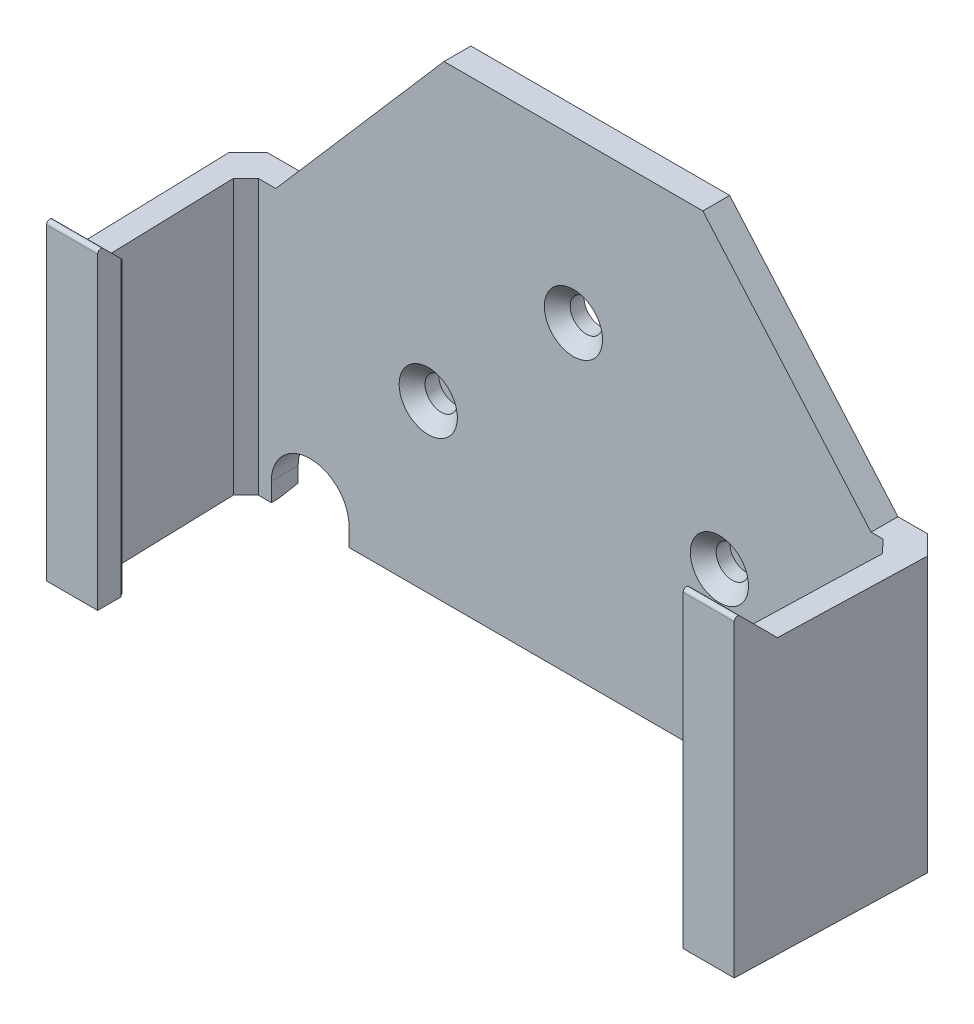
ISO-10303-21;
HEADER;
FILE_DESCRIPTION(('STEP AP214'),'2;1');
FILE_NAME('part.step','',(''),(''),'','','');
FILE_SCHEMA(('AUTOMOTIVE_DESIGN { 1 0 10303 214 1 1 1 1 }'));
ENDSEC;
DATA;
#1=APPLICATION_CONTEXT('core data for automotive mechanical design processes');
#2=APPLICATION_PROTOCOL_DEFINITION('international standard','automotive_design',2000,#1);
#3=PRODUCT_CONTEXT('',#1,'mechanical');
#4=PRODUCT('Part','Part','',(#3));
#5=PRODUCT_RELATED_PRODUCT_CATEGORY('part','',(#4));
#6=PRODUCT_DEFINITION_FORMATION('','',#4);
#7=PRODUCT_DEFINITION_CONTEXT('part definition',#1,'design');
#8=PRODUCT_DEFINITION('design','',#6,#7);
#9=PRODUCT_DEFINITION_SHAPE('','',#8);
#10=(LENGTH_UNIT() NAMED_UNIT(*) SI_UNIT(.MILLI.,.METRE.));
#11=(NAMED_UNIT(*) PLANE_ANGLE_UNIT() SI_UNIT($,.RADIAN.));
#12=(NAMED_UNIT(*) SI_UNIT($,.STERADIAN.) SOLID_ANGLE_UNIT());
#13=UNCERTAINTY_MEASURE_WITH_UNIT(LENGTH_MEASURE(1.E-05),#10,'distance_accuracy_value','');
#14=(GEOMETRIC_REPRESENTATION_CONTEXT(3) GLOBAL_UNCERTAINTY_ASSIGNED_CONTEXT((#13)) GLOBAL_UNIT_ASSIGNED_CONTEXT((#10,
#11,#12)) REPRESENTATION_CONTEXT('',''));
#15=CARTESIAN_POINT('',(0.,0.,0.));
#16=DIRECTION('',(0.,0.,1.));
#17=DIRECTION('',(1.,0.,0.));
#18=AXIS2_PLACEMENT_3D('',#15,#16,#17);
#19=CARTESIAN_POINT('',(0.,0.,0.));
#20=DIRECTION('',(0.,0.,-1.));
#21=DIRECTION('',(-1.,0.,0.));
#22=AXIS2_PLACEMENT_3D('',#19,#20,#21);
#23=PLANE('',#22);
#24=DIRECTION('',(1.,0.,0.));
#25=VECTOR('',#24,1.);
#26=CARTESIAN_POINT('',(0.,-0.345259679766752,0.));
#27=LINE('',#26,#25);
#28=CARTESIAN_POINT('',(3.,-0.345259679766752,0.));
#29=VERTEX_POINT('',#28);
#30=CARTESIAN_POINT('',(7.75000000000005,-0.345259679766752,0.));
#31=VERTEX_POINT('',#30);
#32=EDGE_CURVE('E376',#29,#31,#27,.T.);
#33=ORIENTED_EDGE('',*,*,#32,.F.);
#34=DIRECTION('',(0.,1.,0.));
#35=VECTOR('',#34,1.);
#36=CARTESIAN_POINT('',(3.,48.,0.));
#37=LINE('',#36,#35);
#38=CARTESIAN_POINT('',(3.,41.5,0.));
#39=VERTEX_POINT('',#38);
#40=EDGE_CURVE('E373',#29,#39,#37,.T.);
#41=ORIENTED_EDGE('',*,*,#40,.T.);
#42=DIRECTION('',(-1.,0.,0.));
#43=VECTOR('',#42,1.);
#44=CARTESIAN_POINT('',(116.,41.5,0.));
#45=LINE('',#44,#43);
#46=CARTESIAN_POINT('',(8.44057826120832,41.5,0.));
#47=VERTEX_POINT('',#46);
#48=EDGE_CURVE('E821',#47,#39,#45,.T.);
#49=ORIENTED_EDGE('',*,*,#48,.F.);
#50=DIRECTION('',(0.654930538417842,0.755689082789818,0.));
#51=VECTOR('',#50,1.);
#52=CARTESIAN_POINT('',(34.4405782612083,71.5,0.));
#53=LINE('',#52,#51);
#54=CARTESIAN_POINT('',(34.4405782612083,71.5,0.));
#55=VERTEX_POINT('',#54);
#56=EDGE_CURVE('E727',#47,#55,#53,.T.);
#57=ORIENTED_EDGE('',*,*,#56,.T.);
#58=DIRECTION('',(1.,0.,0.));
#59=VECTOR('',#58,1.);
#60=CARTESIAN_POINT('',(74.4405782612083,71.5,0.));
#61=LINE('',#60,#59);
#62=CARTESIAN_POINT('',(74.4405782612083,71.5,0.));
#63=VERTEX_POINT('',#62);
#64=EDGE_CURVE('E738',#55,#63,#61,.T.);
#65=ORIENTED_EDGE('',*,*,#64,.T.);
#66=DIRECTION('',(0.654930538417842,-0.755689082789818,0.));
#67=VECTOR('',#66,1.);
#68=CARTESIAN_POINT('',(100.440578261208,41.5,0.));
#69=LINE('',#68,#67);
#70=CARTESIAN_POINT('',(100.440578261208,41.5,0.));
#71=VERTEX_POINT('',#70);
#72=EDGE_CURVE('E742',#63,#71,#69,.T.);
#73=ORIENTED_EDGE('',*,*,#72,.T.);
#74=CARTESIAN_POINT('',(105.,41.5,0.));
#75=VERTEX_POINT('',#74);
#76=EDGE_CURVE('E827',#75,#71,#45,.T.);
#77=ORIENTED_EDGE('',*,*,#76,.F.);
#78=DIRECTION('',(0.,-1.,0.));
#79=VECTOR('',#78,1.);
#80=CARTESIAN_POINT('',(105.,0.,0.));
#81=LINE('',#80,#79);
#82=CARTESIAN_POINT('',(105.,-0.345259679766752,0.));
#83=VERTEX_POINT('',#82);
#84=EDGE_CURVE('E394',#75,#83,#81,.T.);
#85=ORIENTED_EDGE('',*,*,#84,.T.);
#86=CARTESIAN_POINT('',(100.75,-0.345259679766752,0.));
#87=VERTEX_POINT('',#86);
#88=EDGE_CURVE('E573',#87,#83,#27,.T.);
#89=ORIENTED_EDGE('',*,*,#88,.F.);
#90=DIRECTION('',(0.,-1.,0.));
#91=VECTOR('',#90,1.);
#92=CARTESIAN_POINT('',(100.75,1.99999999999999,0.));
#93=LINE('',#92,#91);
#94=CARTESIAN_POINT('',(100.75,1.99999999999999,0.));
#95=VERTEX_POINT('',#94);
#96=EDGE_CURVE('E795',#95,#87,#93,.T.);
#97=ORIENTED_EDGE('',*,*,#96,.F.);
#98=CARTESIAN_POINT('',(94.7500000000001,2.,0.));
#99=DIRECTION('',(0.,0.,-1.));
#100=DIRECTION('',(-1.,0.,0.));
#101=AXIS2_PLACEMENT_3D('',#98,#99,#100);
#102=CIRCLE('',#101,5.99999999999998);
#103=CARTESIAN_POINT('',(88.7500000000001,2.,0.));
#104=VERTEX_POINT('',#103);
#105=EDGE_CURVE('E771',#104,#95,#102,.T.);
#106=ORIENTED_EDGE('',*,*,#105,.F.);
#107=DIRECTION('',(0.,1.,0.));
#108=VECTOR('',#107,1.);
#109=CARTESIAN_POINT('',(88.7500000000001,2.,0.));
#110=LINE('',#109,#108);
#111=CARTESIAN_POINT('',(88.7500000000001,-0.345259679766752,0.));
#112=VERTEX_POINT('',#111);
#113=EDGE_CURVE('E789',#112,#104,#110,.T.);
#114=ORIENTED_EDGE('',*,*,#113,.F.);
#115=CARTESIAN_POINT('',(85.4405782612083,-0.34525967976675,0.));
#116=VERTEX_POINT('',#115);
#117=EDGE_CURVE('E574',#116,#112,#27,.T.);
#118=ORIENTED_EDGE('',*,*,#117,.F.);
#119=DIRECTION('',(0.,1.,0.));
#120=VECTOR('',#119,1.);
#121=CARTESIAN_POINT('',(85.4405782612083,56.0555486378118,0.));
#122=LINE('',#121,#120);
#123=CARTESIAN_POINT('',(85.4405782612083,56.0555486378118,0.));
#124=VERTEX_POINT('',#123);
#125=EDGE_CURVE('E528',#116,#124,#122,.T.);
#126=ORIENTED_EDGE('',*,*,#125,.T.);
#127=DIRECTION('',(-1.,0.,0.));
#128=VECTOR('',#127,1.);
#129=CARTESIAN_POINT('',(84.4405782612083,56.0555486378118,0.));
#130=LINE('',#129,#128);
#131=CARTESIAN_POINT('',(63.4405782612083,56.0555486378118,0.));
#132=VERTEX_POINT('',#131);
#133=EDGE_CURVE('E718',#124,#132,#130,.T.);
#134=ORIENTED_EDGE('',*,*,#133,.T.);
#135=DIRECTION('',(0.,-1.,0.));
#136=VECTOR('',#135,1.);
#137=CARTESIAN_POINT('',(63.4405782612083,-8.99999999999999,0.));
#138=LINE('',#137,#136);
#139=CARTESIAN_POINT('',(63.4405782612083,-0.345259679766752,0.));
#140=VERTEX_POINT('',#139);
#141=EDGE_CURVE('E524',#132,#140,#138,.T.);
#142=ORIENTED_EDGE('',*,*,#141,.T.);
#143=CARTESIAN_POINT('',(45.4405782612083,-0.345259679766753,0.));
#144=VERTEX_POINT('',#143);
#145=EDGE_CURVE('E566',#144,#140,#27,.T.);
#146=ORIENTED_EDGE('',*,*,#145,.F.);
#147=DIRECTION('',(0.,-1.,0.));
#148=VECTOR('',#147,1.);
#149=CARTESIAN_POINT('',(45.4405782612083,0.,0.));
#150=LINE('',#149,#148);
#151=CARTESIAN_POINT('',(45.4405782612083,56.0555486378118,0.));
#152=VERTEX_POINT('',#151);
#153=EDGE_CURVE('E521',#144,#152,#150,.F.);
#154=ORIENTED_EDGE('',*,*,#153,.T.);
#155=DIRECTION('',(-1.,0.,0.));
#156=VECTOR('',#155,1.);
#157=CARTESIAN_POINT('',(44.4405782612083,56.0555486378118,0.));
#158=LINE('',#157,#156);
#159=CARTESIAN_POINT('',(23.4405782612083,56.0555486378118,0.));
#160=VERTEX_POINT('',#159);
#161=EDGE_CURVE('E710',#152,#160,#158,.T.);
#162=ORIENTED_EDGE('',*,*,#161,.T.);
#163=DIRECTION('',(0.,-1.,0.));
#164=VECTOR('',#163,1.);
#165=CARTESIAN_POINT('',(23.4405782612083,-8.99999999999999,0.));
#166=LINE('',#165,#164);
#167=CARTESIAN_POINT('',(23.4405782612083,-0.345259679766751,0.));
#168=VERTEX_POINT('',#167);
#169=EDGE_CURVE('E531',#160,#168,#166,.T.);
#170=ORIENTED_EDGE('',*,*,#169,.T.);
#171=CARTESIAN_POINT('',(19.7500000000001,-0.345259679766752,0.));
#172=VERTEX_POINT('',#171);
#173=EDGE_CURVE('E597',#172,#168,#27,.T.);
#174=ORIENTED_EDGE('',*,*,#173,.F.);
#175=DIRECTION('',(0.,-1.,0.));
#176=VECTOR('',#175,1.);
#177=CARTESIAN_POINT('',(19.7500000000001,2.,0.));
#178=LINE('',#177,#176);
#179=CARTESIAN_POINT('',(19.7500000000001,2.,0.));
#180=VERTEX_POINT('',#179);
#181=EDGE_CURVE('E770',#180,#172,#178,.T.);
#182=ORIENTED_EDGE('',*,*,#181,.F.);
#183=CARTESIAN_POINT('',(13.7500000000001,2.,0.));
#184=DIRECTION('',(0.,0.,-1.));
#185=DIRECTION('',(1.,0.,0.));
#186=AXIS2_PLACEMENT_3D('',#183,#184,#185);
#187=CIRCLE('',#186,6.00000000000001);
#188=CARTESIAN_POINT('',(7.75000000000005,2.,0.));
#189=VERTEX_POINT('',#188);
#190=EDGE_CURVE('E766',#189,#180,#187,.T.);
#191=ORIENTED_EDGE('',*,*,#190,.F.);
#192=DIRECTION('',(0.,1.,0.));
#193=VECTOR('',#192,1.);
#194=CARTESIAN_POINT('',(7.75000000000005,2.,0.));
#195=LINE('',#194,#193);
#196=EDGE_CURVE('E775',#31,#189,#195,.T.);
#197=ORIENTED_EDGE('',*,*,#196,.F.);
#198=EDGE_LOOP('',(#33,#41,#49,#57,#65,#73,#77,#85,#89,#97,#106,#114,#118,#126,#134,#142,#146,
#154,#162,#170,#174,#182,#191,#197));
#199=FACE_BOUND('',#198,.T.);
#200=CARTESIAN_POINT('',(54.4405782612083,46.5,0.));
#201=DIRECTION('',(0.,0.,-1.));
#202=DIRECTION('',(-1.,0.,0.));
#203=AXIS2_PLACEMENT_3D('',#200,#201,#202);
#204=CIRCLE('',#203,2.5);
#205=CARTESIAN_POINT('',(51.9405782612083,46.5,0.));
#206=VERTEX_POINT('',#205);
#207=EDGE_CURVE('E723',#206,#206,#204,.T.);
#208=ORIENTED_EDGE('',*,*,#207,.F.);
#209=EDGE_LOOP('',(#208));
#210=FACE_BOUND('',#209,.T.);
#211=ADVANCED_FACE('F51',(#199,#210),#23,.T.);
#212=CARTESIAN_POINT('',(116.,41.5,25.5));
#213=DIRECTION('',(0.,-1.,0.));
#214=DIRECTION('',(0.,0.,-1.));
#215=AXIS2_PLACEMENT_3D('',#212,#213,#214);
#216=PLANE('',#215);
#217=ORIENTED_EDGE('',*,*,#76,.T.);
#218=DIRECTION('',(0.,0.,-1.));
#219=VECTOR('',#218,1.);
#220=CARTESIAN_POINT('',(100.440578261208,41.5,100.917662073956));
#221=LINE('',#220,#219);
#222=CARTESIAN_POINT('',(100.440578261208,41.5,4.14989884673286));
#223=VERTEX_POINT('',#222);
#224=EDGE_CURVE('E732',#223,#71,#221,.T.);
#225=ORIENTED_EDGE('',*,*,#224,.F.);
#226=DIRECTION('',(-1.,0.,0.));
#227=VECTOR('',#226,1.);
#228=CARTESIAN_POINT('',(104.25,41.5,4.14989884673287));
#229=LINE('',#228,#227);
#230=CARTESIAN_POINT('',(102.30687413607,41.5,4.14989884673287));
#231=VERTEX_POINT('',#230);
#232=EDGE_CURVE('E838',#231,#223,#229,.T.);
#233=ORIENTED_EDGE('',*,*,#232,.F.);
#234=DIRECTION('',(0.685785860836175,0.,0.727803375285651));
#235=VECTOR('',#234,1.);
#236=CARTESIAN_POINT('',(119.402986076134,41.5,22.2934749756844));
#237=LINE('',#236,#235);
#238=CARTESIAN_POINT('',(104.190578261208,41.5,6.14901591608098));
#239=VERTEX_POINT('',#238);
#240=EDGE_CURVE('E506',#231,#239,#237,.T.);
#241=ORIENTED_EDGE('',*,*,#240,.T.);
#242=DIRECTION('',(-0.0297108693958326,0.,0.999558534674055));
#243=VECTOR('',#242,1.);
#244=CARTESIAN_POINT('',(104.25,41.5,4.14989884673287));
#245=LINE('',#244,#243);
#246=CARTESIAN_POINT('',(103.615389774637,41.5,25.5));
#247=VERTEX_POINT('',#246);
#248=EDGE_CURVE('E834',#239,#247,#245,.T.);
#249=ORIENTED_EDGE('',*,*,#248,.T.);
#250=DIRECTION('',(-1.,0.,0.));
#251=VECTOR('',#250,1.);
#252=CARTESIAN_POINT('',(116.,41.5,25.5));
#253=LINE('',#252,#251);
#254=CARTESIAN_POINT('',(107.331210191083,41.5,25.5));
#255=VERTEX_POINT('',#254);
#256=EDGE_CURVE('E826',#255,#247,#253,.T.);
#257=ORIENTED_EDGE('',*,*,#256,.F.);
#258=DIRECTION('',(0.0297108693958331,0.,-0.999558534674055));
#259=VECTOR('',#258,1.);
#260=CARTESIAN_POINT('',(107.338862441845,41.5,25.2425564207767));
#261=LINE('',#260,#259);
#262=CARTESIAN_POINT('',(108.,41.5,3.));
#263=VERTEX_POINT('',#262);
#264=EDGE_CURVE('E817',#255,#263,#261,.T.);
#265=ORIENTED_EDGE('',*,*,#264,.T.);
#266=DIRECTION('',(-0.707106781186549,0.,-0.707106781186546));
#267=VECTOR('',#266,1.);
#268=CARTESIAN_POINT('',(108.,41.5,2.99999999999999));
#269=LINE('',#268,#267);
#270=EDGE_CURVE('E831',#263,#75,#269,.T.);
#271=ORIENTED_EDGE('',*,*,#270,.T.);
#272=EDGE_LOOP('',(#217,#225,#233,#241,#249,#257,#265,#271));
#273=FACE_BOUND('',#272,.T.);
#274=ADVANCED_FACE('F969',(#273),#216,.F.);
#275=CARTESIAN_POINT('',(0.,0.,32.));
#276=DIRECTION('',(0.,0.,-1.));
#277=DIRECTION('',(-1.,0.,0.));
#278=AXIS2_PLACEMENT_3D('',#275,#276,#277);
#279=PLANE('',#278);
#280=DIRECTION('',(0.,1.,0.));
#281=VECTOR('',#280,1.);
#282=CARTESIAN_POINT('',(0.861995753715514,-8.49999999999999,32.));
#283=LINE('',#282,#281);
#284=CARTESIAN_POINT('',(0.861995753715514,-0.899999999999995,32.));
#285=VERTEX_POINT('',#284);
#286=CARTESIAN_POINT('',(0.861995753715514,46.7928932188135,32.));
#287=VERTEX_POINT('',#286);
#288=EDGE_CURVE('E802',#285,#287,#283,.T.);
#289=ORIENTED_EDGE('',*,*,#288,.F.);
#290=DIRECTION('',(1.,0.,0.));
#291=VECTOR('',#290,1.);
#292=CARTESIAN_POINT('',(0.,-0.899999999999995,32.));
#293=LINE('',#292,#291);
#294=CARTESIAN_POINT('',(8.75000000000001,-0.899999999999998,32.));
#295=VERTEX_POINT('',#294);
#296=EDGE_CURVE('E382',#285,#295,#293,.T.);
#297=ORIENTED_EDGE('',*,*,#296,.T.);
#298=DIRECTION('',(0.,-1.,0.));
#299=VECTOR('',#298,1.);
#300=CARTESIAN_POINT('',(8.75000000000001,0.,32.));
#301=LINE('',#300,#299);
#302=CARTESIAN_POINT('',(8.75000000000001,46.7928932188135,32.));
#303=VERTEX_POINT('',#302);
#304=EDGE_CURVE('E877',#303,#295,#301,.T.);
#305=ORIENTED_EDGE('',*,*,#304,.F.);
#306=DIRECTION('',(-1.,0.,0.));
#307=VECTOR('',#306,1.);
#308=CARTESIAN_POINT('',(0.,46.7928932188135,32.));
#309=LINE('',#308,#307);
#310=EDGE_CURVE('E417',#303,#287,#309,.T.);
#311=ORIENTED_EDGE('',*,*,#310,.T.);
#312=EDGE_LOOP('',(#289,#297,#305,#311));
#313=FACE_BOUND('',#312,.T.);
#314=ADVANCED_FACE('F976',(#313),#279,.F.);
#315=DIRECTION('',(0.,-1.,0.));
#316=VECTOR('',#315,1.);
#317=CARTESIAN_POINT('',(99.25,0.,32.));
#318=LINE('',#317,#316);
#319=CARTESIAN_POINT('',(99.25,46.7928932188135,32.));
#320=VERTEX_POINT('',#319);
#321=CARTESIAN_POINT('',(99.25,-0.899999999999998,32.));
#322=VERTEX_POINT('',#321);
#323=EDGE_CURVE('E889',#320,#322,#318,.T.);
#324=ORIENTED_EDGE('',*,*,#323,.T.);
#325=DIRECTION('',(1.,0.,0.));
#326=VECTOR('',#325,1.);
#327=CARTESIAN_POINT('',(0.,-0.899999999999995,32.));
#328=LINE('',#327,#326);
#329=CARTESIAN_POINT('',(107.138004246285,-0.899999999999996,32.));
#330=VERTEX_POINT('',#329);
#331=EDGE_CURVE('E678',#322,#330,#328,.T.);
#332=ORIENTED_EDGE('',*,*,#331,.T.);
#333=DIRECTION('',(0.,1.,0.));
#334=VECTOR('',#333,1.);
#335=CARTESIAN_POINT('',(107.138004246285,-8.49999999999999,32.));
#336=LINE('',#335,#334);
#337=CARTESIAN_POINT('',(107.138004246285,46.7928932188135,32.));
#338=VERTEX_POINT('',#337);
#339=EDGE_CURVE('E783',#330,#338,#336,.T.);
#340=ORIENTED_EDGE('',*,*,#339,.T.);
#341=DIRECTION('',(-1.,0.,0.));
#342=VECTOR('',#341,1.);
#343=CARTESIAN_POINT('',(0.,46.7928932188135,32.));
#344=LINE('',#343,#342);
#345=EDGE_CURVE('E407',#338,#320,#344,.T.);
#346=ORIENTED_EDGE('',*,*,#345,.T.);
#347=EDGE_LOOP('',(#324,#332,#340,#346));
#348=FACE_BOUND('',#347,.T.);
#349=ADVANCED_FACE('F981',(#348),#279,.F.);
#350=CARTESIAN_POINT('',(99.75,-71.,27.6998988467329));
#351=DIRECTION('',(0.,0.,1.));
#352=DIRECTION('',(1.,0.,0.));
#353=AXIS2_PLACEMENT_3D('',#350,#351,#352);
#354=PLANE('',#353);
#355=DIRECTION('',(0.,1.,0.));
#356=VECTOR('',#355,1.);
#357=CARTESIAN_POINT('',(103.355856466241,-71.,27.6998988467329));
#358=LINE('',#357,#356);
#359=CARTESIAN_POINT('',(103.355856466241,43.6998988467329,27.6998988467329));
#360=VERTEX_POINT('',#359);
#361=CARTESIAN_POINT('',(103.355856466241,-0.899999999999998,27.6998988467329));
#362=VERTEX_POINT('',#361);
#363=EDGE_CURVE('E475',#360,#362,#358,.F.);
#364=ORIENTED_EDGE('',*,*,#363,.T.);
#365=DIRECTION('',(-1.,0.,0.));
#366=VECTOR('',#365,1.);
#367=CARTESIAN_POINT('',(99.75,-0.899999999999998,27.6998988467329));
#368=LINE('',#367,#366);
#369=CARTESIAN_POINT('',(99.75,-0.899999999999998,27.6998988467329));
#370=VERTEX_POINT('',#369);
#371=EDGE_CURVE('E663',#362,#370,#368,.T.);
#372=ORIENTED_EDGE('',*,*,#371,.T.);
#373=DIRECTION('',(0.,1.,0.));
#374=VECTOR('',#373,1.);
#375=CARTESIAN_POINT('',(99.75,-71.,27.6998988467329));
#376=LINE('',#375,#374);
#377=CARTESIAN_POINT('',(99.75,43.6998988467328,27.6998988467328));
#378=VERTEX_POINT('',#377);
#379=EDGE_CURVE('E874',#370,#378,#376,.T.);
#380=ORIENTED_EDGE('',*,*,#379,.T.);
#381=DIRECTION('',(1.,0.,0.));
#382=VECTOR('',#381,1.);
#383=CARTESIAN_POINT('',(99.7499999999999,43.6998988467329,27.6998988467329));
#384=LINE('',#383,#382);
#385=EDGE_CURVE('E865',#378,#360,#384,.T.);
#386=ORIENTED_EDGE('',*,*,#385,.T.);
#387=EDGE_LOOP('',(#364,#372,#380,#386));
#388=FACE_BOUND('',#387,.T.);
#389=ADVANCED_FACE('F1129',(#388),#354,.F.);
#390=CARTESIAN_POINT('',(99.75,-71.,27.6998988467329));
#391=DIRECTION('',(-0.823462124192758,0.,-0.56737124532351));
#392=DIRECTION('',(-0.56737124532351,0.,0.823462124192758));
#393=AXIS2_PLACEMENT_3D('',#390,#391,#392);
#394=PLANE('',#393);
#395=DIRECTION('',(0.56737124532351,0.,-0.823462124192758));
#396=VECTOR('',#395,1.);
#397=CARTESIAN_POINT('',(99.75,-0.899999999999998,27.6998988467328));
#398=LINE('',#397,#396);
#399=CARTESIAN_POINT('',(99.25,-0.899999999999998,28.425580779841));
#400=VERTEX_POINT('',#399);
#401=EDGE_CURVE('E667',#400,#370,#398,.T.);
#402=ORIENTED_EDGE('',*,*,#401,.F.);
#403=DIRECTION('',(0.,1.,0.));
#404=VECTOR('',#403,1.);
#405=CARTESIAN_POINT('',(99.25,-71.,28.425580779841));
#406=LINE('',#405,#404);
#407=CARTESIAN_POINT('',(99.25,44.425580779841,28.425580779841));
#408=VERTEX_POINT('',#407);
#409=EDGE_CURVE('E878',#400,#408,#406,.T.);
#410=ORIENTED_EDGE('',*,*,#409,.T.);
#411=DIRECTION('',(-0.437985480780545,0.635676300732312,0.635676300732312));
#412=VECTOR('',#411,1.);
#413=CARTESIAN_POINT('',(131.684400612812,-2.64853629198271,-18.6485362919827));
#414=LINE('',#413,#412);
#415=EDGE_CURVE('E861',#378,#408,#414,.T.);
#416=ORIENTED_EDGE('',*,*,#415,.F.);
#417=ORIENTED_EDGE('',*,*,#379,.F.);
#418=EDGE_LOOP('',(#402,#410,#416,#417));
#419=FACE_BOUND('',#418,.T.);
#420=ADVANCED_FACE('F1125',(#419),#394,.T.);
#421=CARTESIAN_POINT('',(8.25000000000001,-71.,27.6998988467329));
#422=DIRECTION('',(-0.823462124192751,0.,0.567371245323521));
#423=DIRECTION('',(0.567371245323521,0.,0.823462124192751));
#424=AXIS2_PLACEMENT_3D('',#421,#422,#423);
#425=PLANE('',#424);
#426=DIRECTION('',(0.,1.,0.));
#427=VECTOR('',#426,1.);
#428=CARTESIAN_POINT('',(8.75000000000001,-71.,28.4255807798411));
#429=LINE('',#428,#427);
#430=CARTESIAN_POINT('',(8.75000000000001,-0.899999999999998,28.4255807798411));
#431=VERTEX_POINT('',#430);
#432=CARTESIAN_POINT('',(8.75000000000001,44.425580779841,28.4255807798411));
#433=VERTEX_POINT('',#432);
#434=EDGE_CURVE('E881',#431,#433,#429,.T.);
#435=ORIENTED_EDGE('',*,*,#434,.F.);
#436=DIRECTION('',(-0.567371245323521,0.,-0.823462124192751));
#437=VECTOR('',#436,1.);
#438=CARTESIAN_POINT('',(8.25,-0.899999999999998,27.6998988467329));
#439=LINE('',#438,#437);
#440=CARTESIAN_POINT('',(8.25000000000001,-0.899999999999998,27.6998988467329));
#441=VERTEX_POINT('',#440);
#442=EDGE_CURVE('E641',#431,#441,#439,.T.);
#443=ORIENTED_EDGE('',*,*,#442,.T.);
#444=DIRECTION('',(0.,1.,0.));
#445=VECTOR('',#444,1.);
#446=CARTESIAN_POINT('',(8.25000000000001,-71.,27.6998988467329));
#447=LINE('',#446,#445);
#448=CARTESIAN_POINT('',(8.25000000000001,43.6998988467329,27.6998988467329));
#449=VERTEX_POINT('',#448);
#450=EDGE_CURVE('E873',#441,#449,#447,.T.);
#451=ORIENTED_EDGE('',*,*,#450,.T.);
#452=DIRECTION('',(0.437985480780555,0.635676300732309,0.635676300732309));
#453=VECTOR('',#452,1.);
#454=CARTESIAN_POINT('',(-23.6844006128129,-2.6485362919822,-18.6485362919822));
#455=LINE('',#454,#453);
#456=EDGE_CURVE('E845',#449,#433,#455,.T.);
#457=ORIENTED_EDGE('',*,*,#456,.T.);
#458=EDGE_LOOP('',(#435,#443,#451,#457));
#459=FACE_BOUND('',#458,.T.);
#460=ADVANCED_FACE('F1128',(#459),#425,.F.);
#461=CARTESIAN_POINT('',(8.25000000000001,-71.,27.6998988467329));
#462=DIRECTION('',(0.,0.,-1.));
#463=DIRECTION('',(-1.,0.,0.));
#464=AXIS2_PLACEMENT_3D('',#461,#462,#463);
#465=PLANE('',#464);
#466=DIRECTION('',(1.,0.,0.));
#467=VECTOR('',#466,1.);
#468=CARTESIAN_POINT('',(8.25000000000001,-0.899999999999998,27.6998988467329));
#469=LINE('',#468,#467);
#470=CARTESIAN_POINT('',(4.64414353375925,-0.899999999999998,27.6998988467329));
#471=VERTEX_POINT('',#470);
#472=EDGE_CURVE('E638',#471,#441,#469,.T.);
#473=ORIENTED_EDGE('',*,*,#472,.F.);
#474=DIRECTION('',(0.,1.,0.));
#475=VECTOR('',#474,1.);
#476=CARTESIAN_POINT('',(4.64414353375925,-71.,27.6998988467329));
#477=LINE('',#476,#475);
#478=CARTESIAN_POINT('',(4.64414353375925,43.6998988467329,27.6998988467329));
#479=VERTEX_POINT('',#478);
#480=EDGE_CURVE('E479',#471,#479,#477,.T.);
#481=ORIENTED_EDGE('',*,*,#480,.T.);
#482=DIRECTION('',(-1.,0.,0.));
#483=VECTOR('',#482,1.);
#484=CARTESIAN_POINT('',(8.25000000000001,43.6998988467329,27.6998988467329));
#485=LINE('',#484,#483);
#486=EDGE_CURVE('E849',#449,#479,#485,.T.);
#487=ORIENTED_EDGE('',*,*,#486,.F.);
#488=ORIENTED_EDGE('',*,*,#450,.F.);
#489=EDGE_LOOP('',(#473,#481,#487,#488));
#490=FACE_BOUND('',#489,.T.);
#491=ADVANCED_FACE('F1141',(#490),#465,.T.);
#492=CARTESIAN_POINT('',(3.75,-71.,4.14989884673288));
#493=DIRECTION('',(-0.999558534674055,0.,0.0297108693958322));
#494=DIRECTION('',(0.0297108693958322,0.,0.999558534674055));
#495=AXIS2_PLACEMENT_3D('',#492,#493,#494);
#496=PLANE('',#495);
#497=DIRECTION('',(0.,1.,0.));
#498=VECTOR('',#497,1.);
#499=CARTESIAN_POINT('',(4.44423182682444,-71.,27.505841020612));
#500=LINE('',#499,#498);
#501=CARTESIAN_POINT('',(4.44423182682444,43.505841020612,27.505841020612));
#502=VERTEX_POINT('',#501);
#503=CARTESIAN_POINT('',(4.44423182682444,-0.899999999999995,27.5058410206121));
#504=VERTEX_POINT('',#503);
#505=EDGE_CURVE('E482',#502,#504,#500,.F.);
#506=ORIENTED_EDGE('',*,*,#505,.T.);
#507=DIRECTION('',(-0.0297108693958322,0.,-0.999558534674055));
#508=VECTOR('',#507,1.);
#509=CARTESIAN_POINT('',(3.75,-0.899999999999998,4.14989884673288));
#510=LINE('',#509,#508);
#511=CARTESIAN_POINT('',(3.80773195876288,-0.899999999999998,6.09216688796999));
#512=VERTEX_POINT('',#511);
#513=EDGE_CURVE('E627',#504,#512,#510,.T.);
#514=ORIENTED_EDGE('',*,*,#513,.T.);
#515=DIRECTION('',(0.,1.,0.));
#516=VECTOR('',#515,1.);
#517=CARTESIAN_POINT('',(3.80773195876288,41.5,6.09216688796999));
#518=LINE('',#517,#516);
#519=CARTESIAN_POINT('',(3.80773195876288,41.5,6.09216688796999));
#520=VERTEX_POINT('',#519);
#521=EDGE_CURVE('E503',#512,#520,#518,.T.);
#522=ORIENTED_EDGE('',*,*,#521,.T.);
#523=DIRECTION('',(0.0297108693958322,0.,0.999558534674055));
#524=VECTOR('',#523,1.);
#525=CARTESIAN_POINT('',(3.75,41.5,4.14989884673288));
#526=LINE('',#525,#524);
#527=CARTESIAN_POINT('',(4.38461022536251,41.5,25.5));
#528=VERTEX_POINT('',#527);
#529=EDGE_CURVE('E842',#520,#528,#526,.T.);
#530=ORIENTED_EDGE('',*,*,#529,.T.);
#531=DIRECTION('',(0.0210133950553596,0.706950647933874,0.706950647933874));
#532=VECTOR('',#531,1.);
#533=CARTESIAN_POINT('',(2.39592876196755,-25.4049263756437,-41.4049263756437));
#534=LINE('',#533,#532);
#535=EDGE_CURVE('E853',#528,#502,#534,.T.);
#536=ORIENTED_EDGE('',*,*,#535,.T.);
#537=EDGE_LOOP('',(#506,#514,#522,#530,#536));
#538=FACE_BOUND('',#537,.T.);
#539=ADVANCED_FACE('F1145',(#538),#496,.F.);
#540=CARTESIAN_POINT('',(104.25,-71.,4.14989884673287));
#541=DIRECTION('',(0.,0.,-1.));
#542=DIRECTION('',(-1.,0.,0.));
#543=AXIS2_PLACEMENT_3D('',#540,#541,#542);
#544=PLANE('',#543);
#545=CARTESIAN_POINT('',(54.4405782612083,46.5,4.14989884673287));
#546=DIRECTION('',(0.,0.,-1.));
#547=DIRECTION('',(-1.,0.,0.));
#548=AXIS2_PLACEMENT_3D('',#545,#546,#547);
#549=CIRCLE('',#548,4.49999999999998);
#550=CARTESIAN_POINT('',(49.9405782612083,46.5,4.14989884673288));
#551=VERTEX_POINT('',#550);
#552=EDGE_CURVE('E517',#551,#551,#549,.T.);
#553=ORIENTED_EDGE('',*,*,#552,.T.);
#554=EDGE_LOOP('',(#553));
#555=FACE_BOUND('',#554,.T.);
#556=CARTESIAN_POINT('',(77.,24.8351380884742,4.14989884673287));
#557=DIRECTION('',(0.,0.,-1.));
#558=DIRECTION('',(-1.,0.,0.));
#559=AXIS2_PLACEMENT_3D('',#556,#557,#558);
#560=CIRCLE('',#559,4.50000000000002);
#561=CARTESIAN_POINT('',(72.5,24.8351380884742,4.14989884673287));
#562=VERTEX_POINT('',#561);
#563=EDGE_CURVE('E460',#562,#562,#560,.T.);
#564=ORIENTED_EDGE('',*,*,#563,.T.);
#565=EDGE_LOOP('',(#564));
#566=FACE_BOUND('',#565,.T.);
#567=CARTESIAN_POINT('',(32.,24.8351380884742,4.14989884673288));
#568=DIRECTION('',(0.,0.,-1.));
#569=DIRECTION('',(-1.,0.,0.));
#570=AXIS2_PLACEMENT_3D('',#567,#568,#569);
#571=CIRCLE('',#570,4.5);
#572=CARTESIAN_POINT('',(27.5,24.8351380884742,4.14989884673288));
#573=VERTEX_POINT('',#572);
#574=EDGE_CURVE('E456',#573,#573,#571,.T.);
#575=ORIENTED_EDGE('',*,*,#574,.T.);
#576=EDGE_LOOP('',(#575));
#577=FACE_BOUND('',#576,.T.);
#578=DIRECTION('',(0.,-1.,0.));
#579=VECTOR('',#578,1.);
#580=CARTESIAN_POINT('',(5.74999999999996,-9.,4.14989884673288));
#581=LINE('',#580,#579);
#582=CARTESIAN_POINT('',(5.74999999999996,41.5,4.14989884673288));
#583=VERTEX_POINT('',#582);
#584=CARTESIAN_POINT('',(5.74999999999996,-0.899999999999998,4.14989884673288));
#585=VERTEX_POINT('',#584);
#586=EDGE_CURVE('E492',#583,#585,#581,.T.);
#587=ORIENTED_EDGE('',*,*,#586,.T.);
#588=DIRECTION('',(1.,0.,0.));
#589=VECTOR('',#588,1.);
#590=CARTESIAN_POINT('',(104.25,-0.899999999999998,4.14989884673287));
#591=LINE('',#590,#589);
#592=CARTESIAN_POINT('',(7.75000000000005,-0.899999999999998,4.14989884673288));
#593=VERTEX_POINT('',#592);
#594=EDGE_CURVE('E620',#585,#593,#591,.T.);
#595=ORIENTED_EDGE('',*,*,#594,.T.);
#596=DIRECTION('',(0.,1.,0.));
#597=VECTOR('',#596,1.);
#598=CARTESIAN_POINT('',(7.75000000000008,-71.0000000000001,4.14989884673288));
#599=LINE('',#598,#597);
#600=CARTESIAN_POINT('',(7.75000000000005,2.,4.14989884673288));
#601=VERTEX_POINT('',#600);
#602=EDGE_CURVE('E453',#593,#601,#599,.T.);
#603=ORIENTED_EDGE('',*,*,#602,.T.);
#604=CARTESIAN_POINT('',(13.7500000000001,2.,4.14989884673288));
#605=DIRECTION('',(0.,0.,-1.));
#606=DIRECTION('',(-1.,0.,0.));
#607=AXIS2_PLACEMENT_3D('',#604,#605,#606);
#608=CIRCLE('',#607,6.00000000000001);
#609=CARTESIAN_POINT('',(19.7500000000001,2.,4.14989884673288));
#610=VERTEX_POINT('',#609);
#611=EDGE_CURVE('E449',#601,#610,#608,.T.);
#612=ORIENTED_EDGE('',*,*,#611,.T.);
#613=DIRECTION('',(0.,-1.,0.));
#614=VECTOR('',#613,1.);
#615=CARTESIAN_POINT('',(19.7500000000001,-71.,4.14989884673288));
#616=LINE('',#615,#614);
#617=CARTESIAN_POINT('',(19.7500000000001,-0.899999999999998,4.14989884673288));
#618=VERTEX_POINT('',#617);
#619=EDGE_CURVE('E445',#610,#618,#616,.T.);
#620=ORIENTED_EDGE('',*,*,#619,.T.);
#621=CARTESIAN_POINT('',(88.7500000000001,-0.899999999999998,4.14989884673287));
#622=VERTEX_POINT('',#621);
#623=EDGE_CURVE('E614',#618,#622,#591,.T.);
#624=ORIENTED_EDGE('',*,*,#623,.T.);
#625=DIRECTION('',(0.,1.,0.));
#626=VECTOR('',#625,1.);
#627=CARTESIAN_POINT('',(88.7499999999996,-70.9999999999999,4.14989884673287));
#628=LINE('',#627,#626);
#629=CARTESIAN_POINT('',(88.7500000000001,2.,4.14989884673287));
#630=VERTEX_POINT('',#629);
#631=EDGE_CURVE('E442',#622,#630,#628,.T.);
#632=ORIENTED_EDGE('',*,*,#631,.T.);
#633=CARTESIAN_POINT('',(94.7500000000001,2.,4.14989884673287));
#634=DIRECTION('',(0.,0.,-1.));
#635=DIRECTION('',(-1.,0.,0.));
#636=AXIS2_PLACEMENT_3D('',#633,#634,#635);
#637=CIRCLE('',#636,5.99999999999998);
#638=CARTESIAN_POINT('',(100.75,1.99999999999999,4.14989884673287));
#639=VERTEX_POINT('',#638);
#640=EDGE_CURVE('E438',#630,#639,#637,.T.);
#641=ORIENTED_EDGE('',*,*,#640,.T.);
#642=DIRECTION('',(0.,-1.,0.));
#643=VECTOR('',#642,1.);
#644=CARTESIAN_POINT('',(100.750000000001,-71.0000000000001,4.14989884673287));
#645=LINE('',#644,#643);
#646=CARTESIAN_POINT('',(100.75,-0.899999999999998,4.14989884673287));
#647=VERTEX_POINT('',#646);
#648=EDGE_CURVE('E434',#639,#647,#645,.T.);
#649=ORIENTED_EDGE('',*,*,#648,.T.);
#650=CARTESIAN_POINT('',(102.30687413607,-0.899999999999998,4.14989884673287));
#651=VERTEX_POINT('',#650);
#652=EDGE_CURVE('E619',#647,#651,#591,.T.);
#653=ORIENTED_EDGE('',*,*,#652,.T.);
#654=DIRECTION('',(0.,1.,0.));
#655=VECTOR('',#654,1.);
#656=CARTESIAN_POINT('',(102.30687413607,-71.,4.14989884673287));
#657=LINE('',#656,#655);
#658=EDGE_CURVE('E496',#651,#231,#657,.T.);
#659=ORIENTED_EDGE('',*,*,#658,.T.);
#660=ORIENTED_EDGE('',*,*,#232,.T.);
#661=DIRECTION('',(-0.654930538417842,0.755689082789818,0.));
#662=VECTOR('',#661,1.);
#663=CARTESIAN_POINT('',(100.440578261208,41.5,4.14989884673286));
#664=LINE('',#663,#662);
#665=CARTESIAN_POINT('',(74.4405782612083,71.5,4.14989884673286));
#666=VERTEX_POINT('',#665);
#667=EDGE_CURVE('E731',#223,#666,#664,.T.);
#668=ORIENTED_EDGE('',*,*,#667,.T.);
#669=DIRECTION('',(-1.,0.,0.));
#670=VECTOR('',#669,1.);
#671=CARTESIAN_POINT('',(74.4405782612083,71.5,4.14989884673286));
#672=LINE('',#671,#670);
#673=CARTESIAN_POINT('',(34.4405782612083,71.5,4.14989884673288));
#674=VERTEX_POINT('',#673);
#675=EDGE_CURVE('E728',#666,#674,#672,.T.);
#676=ORIENTED_EDGE('',*,*,#675,.T.);
#677=DIRECTION('',(-0.654930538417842,-0.755689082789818,0.));
#678=VECTOR('',#677,1.);
#679=CARTESIAN_POINT('',(34.4405782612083,71.5,4.14989884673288));
#680=LINE('',#679,#678);
#681=CARTESIAN_POINT('',(8.44057826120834,41.5,4.14989884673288));
#682=VERTEX_POINT('',#681);
#683=EDGE_CURVE('E735',#674,#682,#680,.T.);
#684=ORIENTED_EDGE('',*,*,#683,.T.);
#685=EDGE_CURVE('E837',#682,#583,#229,.T.);
#686=ORIENTED_EDGE('',*,*,#685,.T.);
#687=EDGE_LOOP('',(#587,#595,#603,#612,#620,#624,#632,#641,#649,#653,#659,#660,#668,#676,#684,#686));
#688=FACE_BOUND('',#687,.T.);
#689=ADVANCED_FACE('F929',(#555,#566,#577,#688),#544,.F.);
#690=CARTESIAN_POINT('',(104.25,-71.,4.14989884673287));
#691=DIRECTION('',(-0.999558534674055,0.,-0.0297108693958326));
#692=DIRECTION('',(-0.0297108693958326,0.,0.999558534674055));
#693=AXIS2_PLACEMENT_3D('',#690,#691,#692);
#694=PLANE('',#693);
#695=DIRECTION('',(0.0297108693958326,0.,-0.999558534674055));
#696=VECTOR('',#695,1.);
#697=CARTESIAN_POINT('',(104.25,-0.899999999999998,4.14989884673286));
#698=LINE('',#697,#696);
#699=CARTESIAN_POINT('',(103.555768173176,-0.899999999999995,27.505841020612));
#700=VERTEX_POINT('',#699);
#701=CARTESIAN_POINT('',(104.190578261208,-0.899999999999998,6.14901591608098));
#702=VERTEX_POINT('',#701);
#703=EDGE_CURVE('E653',#700,#702,#698,.T.);
#704=ORIENTED_EDGE('',*,*,#703,.F.);
#705=DIRECTION('',(0.,1.,0.));
#706=VECTOR('',#705,1.);
#707=CARTESIAN_POINT('',(103.555768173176,-71.,27.505841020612));
#708=LINE('',#707,#706);
#709=CARTESIAN_POINT('',(103.555768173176,43.505841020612,27.505841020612));
#710=VERTEX_POINT('',#709);
#711=EDGE_CURVE('E472',#700,#710,#708,.T.);
#712=ORIENTED_EDGE('',*,*,#711,.T.);
#713=DIRECTION('',(-0.0210133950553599,0.706950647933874,0.706950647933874));
#714=VECTOR('',#713,1.);
#715=CARTESIAN_POINT('',(105.604071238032,-25.4049263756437,-41.4049263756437));
#716=LINE('',#715,#714);
#717=EDGE_CURVE('E869',#247,#710,#716,.T.);
#718=ORIENTED_EDGE('',*,*,#717,.F.);
#719=ORIENTED_EDGE('',*,*,#248,.F.);
#720=DIRECTION('',(0.,-1.,0.));
#721=VECTOR('',#720,1.);
#722=CARTESIAN_POINT('',(104.190578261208,-71.,6.14901591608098));
#723=LINE('',#722,#721);
#724=EDGE_CURVE('E499',#239,#702,#723,.T.);
#725=ORIENTED_EDGE('',*,*,#724,.T.);
#726=EDGE_LOOP('',(#704,#712,#718,#719,#725));
#727=FACE_BOUND('',#726,.T.);
#728=ADVANCED_FACE('F1134',(#727),#694,.T.);
#729=CARTESIAN_POINT('',(99.25,-71.,32.));
#730=DIRECTION('',(1.,0.,0.));
#731=DIRECTION('',(0.,0.,-1.));
#732=AXIS2_PLACEMENT_3D('',#729,#730,#731);
#733=PLANE('',#732);
#734=ORIENTED_EDGE('',*,*,#409,.F.);
#735=DIRECTION('',(0.,0.,1.));
#736=VECTOR('',#735,1.);
#737=CARTESIAN_POINT('',(99.25,-0.899999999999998,32.));
#738=LINE('',#737,#736);
#739=EDGE_CURVE('E674',#400,#322,#738,.T.);
#740=ORIENTED_EDGE('',*,*,#739,.T.);
#741=ORIENTED_EDGE('',*,*,#323,.F.);
#742=CARTESIAN_POINT('',(99.25,46.7928932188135,31.5));
#743=DIRECTION('',(1.,0.,0.));
#744=DIRECTION('',(0.,0.,-1.));
#745=AXIS2_PLACEMENT_3D('',#742,#743,#744);
#746=CIRCLE('',#745,0.5);
#747=CARTESIAN_POINT('',(99.25,47.1464466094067,31.1464466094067));
#748=VERTEX_POINT('',#747);
#749=EDGE_CURVE('E410',#320,#748,#746,.F.);
#750=ORIENTED_EDGE('',*,*,#749,.T.);
#751=DIRECTION('',(0.,-0.707106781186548,-0.707106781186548));
#752=VECTOR('',#751,1.);
#753=CARTESIAN_POINT('',(99.25,-11.5,-27.5));
#754=LINE('',#753,#752);
#755=EDGE_CURVE('E857',#748,#408,#754,.T.);
#756=ORIENTED_EDGE('',*,*,#755,.T.);
#757=EDGE_LOOP('',(#734,#740,#741,#750,#756));
#758=FACE_BOUND('',#757,.T.);
#759=ADVANCED_FACE('F1131',(#758),#733,.F.);
#760=CARTESIAN_POINT('',(8.75000000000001,-71.,32.));
#761=DIRECTION('',(1.,0.,0.));
#762=DIRECTION('',(0.,0.,-1.));
#763=AXIS2_PLACEMENT_3D('',#760,#761,#762);
#764=PLANE('',#763);
#765=DIRECTION('',(0.,0.,1.));
#766=VECTOR('',#765,1.);
#767=CARTESIAN_POINT('',(8.75000000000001,-0.899999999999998,32.));
#768=LINE('',#767,#766);
#769=EDGE_CURVE('E645',#431,#295,#768,.T.);
#770=ORIENTED_EDGE('',*,*,#769,.F.);
#771=ORIENTED_EDGE('',*,*,#434,.T.);
#772=DIRECTION('',(0.,-0.707106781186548,-0.707106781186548));
#773=VECTOR('',#772,1.);
#774=CARTESIAN_POINT('',(8.75000000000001,-11.5,-27.5));
#775=LINE('',#774,#773);
#776=CARTESIAN_POINT('',(8.75000000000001,47.1464466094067,31.1464466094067));
#777=VERTEX_POINT('',#776);
#778=EDGE_CURVE('E398',#777,#433,#775,.T.);
#779=ORIENTED_EDGE('',*,*,#778,.F.);
#780=CARTESIAN_POINT('',(8.75000000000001,46.7928932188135,31.5));
#781=DIRECTION('',(1.,0.,0.));
#782=DIRECTION('',(0.,0.,-1.));
#783=AXIS2_PLACEMENT_3D('',#780,#781,#782);
#784=CIRCLE('',#783,0.5);
#785=EDGE_CURVE('E424',#777,#303,#784,.T.);
#786=ORIENTED_EDGE('',*,*,#785,.T.);
#787=ORIENTED_EDGE('',*,*,#304,.T.);
#788=EDGE_LOOP('',(#770,#771,#779,#786,#787));
#789=FACE_BOUND('',#788,.T.);
#790=ADVANCED_FACE('F990',(#789),#764,.T.);
#791=CARTESIAN_POINT('',(108.,0.,2.99999999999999));
#792=DIRECTION('',(0.707106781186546,0.,-0.707106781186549));
#793=DIRECTION('',(0.,-1.,0.));
#794=AXIS2_PLACEMENT_3D('',#791,#792,#793);
#795=PLANE('',#794);
#796=DIRECTION('',(0.701138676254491,-0.129649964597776,0.701138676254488));
#797=VECTOR('',#796,1.);
#798=CARTESIAN_POINT('',(107.918187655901,-0.884871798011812,2.91818765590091));
#799=LINE('',#798,#797);
#800=CARTESIAN_POINT('',(108.,-0.899999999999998,3.));
#801=VERTEX_POINT('',#800);
#802=EDGE_CURVE('E607',#83,#801,#799,.T.);
#803=ORIENTED_EDGE('',*,*,#802,.F.);
#804=ORIENTED_EDGE('',*,*,#84,.F.);
#805=ORIENTED_EDGE('',*,*,#270,.F.);
#806=DIRECTION('',(0.,1.,0.));
#807=VECTOR('',#806,1.);
#808=CARTESIAN_POINT('',(108.,48.,2.99999999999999));
#809=LINE('',#808,#807);
#810=EDGE_CURVE('E893',#801,#263,#809,.T.);
#811=ORIENTED_EDGE('',*,*,#810,.F.);
#812=EDGE_LOOP('',(#803,#804,#805,#811));
#813=FACE_BOUND('',#812,.T.);
#814=ADVANCED_FACE('F984',(#813),#795,.T.);
#815=CARTESIAN_POINT('',(0.,0.,3.));
#816=DIRECTION('',(-0.707106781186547,0.,-0.707106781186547));
#817=DIRECTION('',(0.,1.,0.));
#818=AXIS2_PLACEMENT_3D('',#815,#816,#817);
#819=PLANE('',#818);
#820=DIRECTION('',(0.701138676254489,0.129649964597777,-0.701138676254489));
#821=VECTOR('',#820,1.);
#822=CARTESIAN_POINT('',(0.0818123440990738,-0.884871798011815,2.91818765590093));
#823=LINE('',#822,#821);
#824=CARTESIAN_POINT('',(0.,-0.899999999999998,3.));
#825=VERTEX_POINT('',#824);
#826=EDGE_CURVE('E357',#825,#29,#823,.T.);
#827=ORIENTED_EDGE('',*,*,#826,.F.);
#828=DIRECTION('',(0.,-1.,0.));
#829=VECTOR('',#828,1.);
#830=CARTESIAN_POINT('',(0.,0.,3.));
#831=LINE('',#830,#829);
#832=CARTESIAN_POINT('',(0.,41.5,3.));
#833=VERTEX_POINT('',#832);
#834=EDGE_CURVE('E372',#833,#825,#831,.T.);
#835=ORIENTED_EDGE('',*,*,#834,.F.);
#836=DIRECTION('',(-0.707106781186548,0.,0.707106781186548));
#837=VECTOR('',#836,1.);
#838=CARTESIAN_POINT('',(0.,41.5,3.));
#839=LINE('',#838,#837);
#840=EDGE_CURVE('E393',#39,#833,#839,.T.);
#841=ORIENTED_EDGE('',*,*,#840,.F.);
#842=ORIENTED_EDGE('',*,*,#40,.F.);
#843=EDGE_LOOP('',(#827,#835,#841,#842));
#844=FACE_BOUND('',#843,.T.);
#845=ADVANCED_FACE('F369',(#844),#819,.T.);
#846=CARTESIAN_POINT('',(116.,48.,32.));
#847=DIRECTION('',(0.,-0.707106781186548,0.707106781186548));
#848=DIRECTION('',(0.,-0.707106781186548,-0.707106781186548));
#849=AXIS2_PLACEMENT_3D('',#846,#847,#848);
#850=PLANE('',#849);
#851=DIRECTION('',(-1.,0.,0.));
#852=VECTOR('',#851,1.);
#853=CARTESIAN_POINT('',(116.,47.1464466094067,31.1464466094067));
#854=LINE('',#853,#852);
#855=CARTESIAN_POINT('',(107.163375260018,47.1464466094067,31.1464466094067));
#856=VERTEX_POINT('',#855);
#857=EDGE_CURVE('E413',#748,#856,#854,.F.);
#858=ORIENTED_EDGE('',*,*,#857,.T.);
#859=DIRECTION('',(0.0210133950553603,-0.706950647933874,-0.706950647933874));
#860=VECTOR('',#859,1.);
#861=CARTESIAN_POINT('',(107.141917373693,47.8683512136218,31.8683512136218));
#862=LINE('',#861,#860);
#863=EDGE_CURVE('E813',#856,#255,#862,.T.);
#864=ORIENTED_EDGE('',*,*,#863,.T.);
#865=ORIENTED_EDGE('',*,*,#256,.T.);
#866=ORIENTED_EDGE('',*,*,#717,.T.);
#867=CARTESIAN_POINT('',(103.355856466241,43.4998988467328,27.4998988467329));
#868=DIRECTION('',(0.,-0.707106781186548,0.707106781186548));
#869=DIRECTION('',(0.,0.707106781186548,0.707106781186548));
#870=AXIS2_PLACEMENT_3D('',#867,#868,#869);
#871=ELLIPSE('',#870,0.282842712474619,0.2);
#872=EDGE_CURVE('E486',#710,#360,#871,.T.);
#873=ORIENTED_EDGE('',*,*,#872,.T.);
#874=ORIENTED_EDGE('',*,*,#385,.F.);
#875=ORIENTED_EDGE('',*,*,#415,.T.);
#876=ORIENTED_EDGE('',*,*,#755,.F.);
#877=EDGE_LOOP('',(#858,#864,#865,#866,#873,#874,#875,#876));
#878=FACE_BOUND('',#877,.T.);
#879=ADVANCED_FACE('F997',(#878),#850,.F.);
#880=CARTESIAN_POINT('',(0.668789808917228,41.5,25.5));
#881=VERTEX_POINT('',#880);
#882=EDGE_CURVE('E822',#528,#881,#253,.T.);
#883=ORIENTED_EDGE('',*,*,#882,.T.);
#884=DIRECTION('',(0.0210133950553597,0.706950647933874,0.706950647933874));
#885=VECTOR('',#884,1.);
#886=CARTESIAN_POINT('',(0.912836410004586,49.7104249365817,33.7104249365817));
#887=LINE('',#886,#885);
#888=CARTESIAN_POINT('',(0.836624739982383,47.1464466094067,31.1464466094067));
#889=VERTEX_POINT('',#888);
#890=EDGE_CURVE('E805',#881,#889,#887,.T.);
#891=ORIENTED_EDGE('',*,*,#890,.T.);
#892=DIRECTION('',(-1.,0.,0.));
#893=VECTOR('',#892,1.);
#894=CARTESIAN_POINT('',(116.,47.1464466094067,31.1464466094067));
#895=LINE('',#894,#893);
#896=EDGE_CURVE('E421',#889,#777,#895,.F.);
#897=ORIENTED_EDGE('',*,*,#896,.T.);
#898=ORIENTED_EDGE('',*,*,#778,.T.);
#899=ORIENTED_EDGE('',*,*,#456,.F.);
#900=ORIENTED_EDGE('',*,*,#486,.T.);
#901=CARTESIAN_POINT('',(4.64414353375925,43.4998988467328,27.4998988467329));
#902=DIRECTION('',(0.,-0.707106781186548,0.707106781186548));
#903=DIRECTION('',(0.,0.707106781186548,0.707106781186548));
#904=AXIS2_PLACEMENT_3D('',#901,#902,#903);
#905=ELLIPSE('',#904,0.282842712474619,0.2);
#906=EDGE_CURVE('E489',#479,#502,#905,.T.);
#907=ORIENTED_EDGE('',*,*,#906,.T.);
#908=ORIENTED_EDGE('',*,*,#535,.F.);
#909=EDGE_LOOP('',(#883,#891,#897,#898,#899,#900,#907,#908));
#910=FACE_BOUND('',#909,.T.);
#911=ADVANCED_FACE('F1121',(#910),#850,.F.);
#912=ORIENTED_EDGE('',*,*,#685,.F.);
#913=DIRECTION('',(0.,0.,-1.));
#914=VECTOR('',#913,1.);
#915=CARTESIAN_POINT('',(8.44057826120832,41.5,100.917662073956));
#916=LINE('',#915,#914);
#917=EDGE_CURVE('E745',#682,#47,#916,.T.);
#918=ORIENTED_EDGE('',*,*,#917,.T.);
#919=ORIENTED_EDGE('',*,*,#48,.T.);
#920=ORIENTED_EDGE('',*,*,#840,.T.);
#921=DIRECTION('',(0.0297108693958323,0.,0.999558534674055));
#922=VECTOR('',#921,1.);
#923=CARTESIAN_POINT('',(0.770596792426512,41.5,28.9250778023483));
#924=LINE('',#923,#922);
#925=EDGE_CURVE('E390',#833,#881,#924,.T.);
#926=ORIENTED_EDGE('',*,*,#925,.T.);
#927=ORIENTED_EDGE('',*,*,#882,.F.);
#928=ORIENTED_EDGE('',*,*,#529,.F.);
#929=DIRECTION('',(-0.707106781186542,0.,0.707106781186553));
#930=VECTOR('',#929,1.);
#931=CARTESIAN_POINT('',(50.1999494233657,41.5,-40.3000505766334));
#932=LINE('',#931,#930);
#933=EDGE_CURVE('E509',#520,#583,#932,.F.);
#934=ORIENTED_EDGE('',*,*,#933,.T.);
#935=EDGE_LOOP('',(#912,#918,#919,#920,#926,#927,#928,#934));
#936=FACE_BOUND('',#935,.T.);
#937=ADVANCED_FACE('F903',(#936),#216,.F.);
#938=CARTESIAN_POINT('',(0.,46.7928932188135,31.5));
#939=DIRECTION('',(-1.,0.,0.));
#940=DIRECTION('',(0.,0.,1.));
#941=AXIS2_PLACEMENT_3D('',#938,#939,#940);
#942=CYLINDRICAL_SURFACE('',#941,0.5);
#943=CARTESIAN_POINT('',(107.152866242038,46.7928932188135,31.5));
#944=DIRECTION('',(-0.999558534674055,0.,-0.0297108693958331));
#945=DIRECTION('',(-0.0297108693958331,0.,0.999558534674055));
#946=AXIS2_PLACEMENT_3D('',#943,#944,#945);
#947=ELLIPSE('',#946,0.500220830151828,0.5);
#948=EDGE_CURVE('E430',#856,#338,#947,.F.);
#949=ORIENTED_EDGE('',*,*,#948,.F.);
#950=ORIENTED_EDGE('',*,*,#857,.F.);
#951=ORIENTED_EDGE('',*,*,#749,.F.);
#952=ORIENTED_EDGE('',*,*,#345,.F.);
#953=EDGE_LOOP('',(#949,#950,#951,#952));
#954=FACE_BOUND('',#953,.T.);
#955=ADVANCED_FACE('F998',(#954),#942,.T.);
#956=CARTESIAN_POINT('',(0.,46.7928932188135,31.5));
#957=DIRECTION('',(-1.,0.,0.));
#958=DIRECTION('',(0.,0.,1.));
#959=AXIS2_PLACEMENT_3D('',#956,#957,#958);
#960=CYLINDRICAL_SURFACE('',#959,0.5);
#961=CARTESIAN_POINT('',(0.847133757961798,46.7928932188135,31.5));
#962=DIRECTION('',(0.999558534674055,0.,-0.0297108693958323));
#963=DIRECTION('',(-0.0297108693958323,0.,-0.999558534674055));
#964=AXIS2_PLACEMENT_3D('',#961,#962,#963);
#965=ELLIPSE('',#964,0.500220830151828,0.5);
#966=EDGE_CURVE('E427',#287,#889,#965,.F.);
#967=ORIENTED_EDGE('',*,*,#966,.F.);
#968=ORIENTED_EDGE('',*,*,#310,.F.);
#969=ORIENTED_EDGE('',*,*,#785,.F.);
#970=ORIENTED_EDGE('',*,*,#896,.F.);
#971=EDGE_LOOP('',(#967,#968,#969,#970));
#972=FACE_BOUND('',#971,.T.);
#973=ADVANCED_FACE('F1001',(#972),#960,.T.);
#974=CARTESIAN_POINT('',(0.,-8.49999999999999,3.00000000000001));
#975=DIRECTION('',(0.999558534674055,0.,-0.0297108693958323));
#976=DIRECTION('',(-0.0297108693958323,0.,-0.999558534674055));
#977=AXIS2_PLACEMENT_3D('',#974,#975,#976);
#978=PLANE('',#977);
#979=ORIENTED_EDGE('',*,*,#834,.T.);
#980=DIRECTION('',(0.0297108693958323,0.,0.999558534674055));
#981=VECTOR('',#980,1.);
#982=CARTESIAN_POINT('',(0.,-0.899999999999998,3.00000000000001));
#983=LINE('',#982,#981);
#984=EDGE_CURVE('E379',#825,#285,#983,.T.);
#985=ORIENTED_EDGE('',*,*,#984,.T.);
#986=ORIENTED_EDGE('',*,*,#288,.T.);
#987=ORIENTED_EDGE('',*,*,#966,.T.);
#988=ORIENTED_EDGE('',*,*,#890,.F.);
#989=ORIENTED_EDGE('',*,*,#925,.F.);
#990=EDGE_LOOP('',(#979,#985,#986,#987,#988,#989));
#991=FACE_BOUND('',#990,.T.);
#992=ADVANCED_FACE('F388',(#991),#978,.F.);
#993=CARTESIAN_POINT('',(108.,-8.49999999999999,3.00000000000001));
#994=DIRECTION('',(-0.999558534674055,0.,-0.0297108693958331));
#995=DIRECTION('',(-0.0297108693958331,0.,0.999558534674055));
#996=AXIS2_PLACEMENT_3D('',#993,#994,#995);
#997=PLANE('',#996);
#998=ORIENTED_EDGE('',*,*,#339,.F.);
#999=DIRECTION('',(0.0297108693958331,0.,-0.999558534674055));
#1000=VECTOR('',#999,1.);
#1001=CARTESIAN_POINT('',(108.,-0.899999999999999,3.00000000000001));
#1002=LINE('',#1001,#1000);
#1003=EDGE_CURVE('E670',#330,#801,#1002,.T.);
#1004=ORIENTED_EDGE('',*,*,#1003,.T.);
#1005=ORIENTED_EDGE('',*,*,#810,.T.);
#1006=ORIENTED_EDGE('',*,*,#264,.F.);
#1007=ORIENTED_EDGE('',*,*,#863,.F.);
#1008=ORIENTED_EDGE('',*,*,#948,.T.);
#1009=EDGE_LOOP('',(#998,#1004,#1005,#1006,#1007,#1008));
#1010=FACE_BOUND('',#1009,.T.);
#1011=ADVANCED_FACE('F1109',(#1010),#997,.F.);
#1012=CARTESIAN_POINT('',(94.7500000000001,2.,4.25));
#1013=DIRECTION('',(0.,0.,-1.));
#1014=DIRECTION('',(-1.,0.,0.));
#1015=AXIS2_PLACEMENT_3D('',#1012,#1013,#1014);
#1016=CYLINDRICAL_SURFACE('',#1015,5.99999999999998);
#1017=DIRECTION('',(0.,0.,-1.));
#1018=VECTOR('',#1017,1.);
#1019=CARTESIAN_POINT('',(88.7500000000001,2.,4.25));
#1020=LINE('',#1019,#1018);
#1021=EDGE_CURVE('E762',#630,#104,#1020,.T.);
#1022=ORIENTED_EDGE('',*,*,#1021,.T.);
#1023=ORIENTED_EDGE('',*,*,#105,.T.);
#1024=DIRECTION('',(0.,0.,-1.));
#1025=VECTOR('',#1024,1.);
#1026=CARTESIAN_POINT('',(100.75,1.99999999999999,4.25));
#1027=LINE('',#1026,#1025);
#1028=EDGE_CURVE('E786',#639,#95,#1027,.T.);
#1029=ORIENTED_EDGE('',*,*,#1028,.F.);
#1030=ORIENTED_EDGE('',*,*,#640,.F.);
#1031=EDGE_LOOP('',(#1022,#1023,#1029,#1030));
#1032=FACE_BOUND('',#1031,.T.);
#1033=ADVANCED_FACE('F926',(#1032),#1016,.F.);
#1034=CARTESIAN_POINT('',(88.7500000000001,2.,4.25));
#1035=DIRECTION('',(-1.,0.,0.));
#1036=DIRECTION('',(0.,-1.,0.));
#1037=AXIS2_PLACEMENT_3D('',#1034,#1035,#1036);
#1038=PLANE('',#1037);
#1039=DIRECTION('',(0.,0.,-1.));
#1040=VECTOR('',#1039,1.);
#1041=CARTESIAN_POINT('',(88.7500000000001,-0.899999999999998,4.25));
#1042=LINE('',#1041,#1040);
#1043=CARTESIAN_POINT('',(88.7500000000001,-0.899999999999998,3.));
#1044=VERTEX_POINT('',#1043);
#1045=EDGE_CURVE('E610',#622,#1044,#1042,.T.);
#1046=ORIENTED_EDGE('',*,*,#1045,.T.);
#1047=DIRECTION('',(0.,0.181830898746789,-0.98332981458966));
#1048=VECTOR('',#1047,1.);
#1049=CARTESIAN_POINT('',(88.7500000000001,-1.0276185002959,3.69015264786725));
#1050=LINE('',#1049,#1048);
#1051=EDGE_CURVE('E67',#1044,#112,#1050,.T.);
#1052=ORIENTED_EDGE('',*,*,#1051,.T.);
#1053=ORIENTED_EDGE('',*,*,#113,.T.);
#1054=ORIENTED_EDGE('',*,*,#1021,.F.);
#1055=ORIENTED_EDGE('',*,*,#631,.F.);
#1056=EDGE_LOOP('',(#1046,#1052,#1053,#1054,#1055));
#1057=FACE_BOUND('',#1056,.T.);
#1058=ADVANCED_FACE('F918',(#1057),#1038,.F.);
#1059=CARTESIAN_POINT('',(100.75,1.99999999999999,4.25));
#1060=DIRECTION('',(1.,0.,0.));
#1061=DIRECTION('',(0.,1.,0.));
#1062=AXIS2_PLACEMENT_3D('',#1059,#1060,#1061);
#1063=PLANE('',#1062);
#1064=ORIENTED_EDGE('',*,*,#96,.T.);
#1065=DIRECTION('',(0.,-0.181830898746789,0.98332981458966));
#1066=VECTOR('',#1065,1.);
#1067=CARTESIAN_POINT('',(100.75,-1.0276185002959,3.69015264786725));
#1068=LINE('',#1067,#1066);
#1069=CARTESIAN_POINT('',(100.75,-0.899999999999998,3.));
#1070=VERTEX_POINT('',#1069);
#1071=EDGE_CURVE('E375',#87,#1070,#1068,.T.);
#1072=ORIENTED_EDGE('',*,*,#1071,.T.);
#1073=DIRECTION('',(0.,0.,1.));
#1074=VECTOR('',#1073,1.);
#1075=CARTESIAN_POINT('',(100.75,-0.899999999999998,4.25));
#1076=LINE('',#1075,#1074);
#1077=EDGE_CURVE('E660',#1070,#647,#1076,.T.);
#1078=ORIENTED_EDGE('',*,*,#1077,.T.);
#1079=ORIENTED_EDGE('',*,*,#648,.F.);
#1080=ORIENTED_EDGE('',*,*,#1028,.T.);
#1081=EDGE_LOOP('',(#1064,#1072,#1078,#1079,#1080));
#1082=FACE_BOUND('',#1081,.T.);
#1083=ADVANCED_FACE('F1105',(#1082),#1063,.F.);
#1084=CARTESIAN_POINT('',(13.7500000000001,2.,4.25));
#1085=DIRECTION('',(0.,0.,-1.));
#1086=DIRECTION('',(-1.,0.,0.));
#1087=AXIS2_PLACEMENT_3D('',#1084,#1085,#1086);
#1088=CYLINDRICAL_SURFACE('',#1087,6.00000000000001);
#1089=DIRECTION('',(0.,0.,-1.));
#1090=VECTOR('',#1089,1.);
#1091=CARTESIAN_POINT('',(7.75000000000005,2.,4.25));
#1092=LINE('',#1091,#1090);
#1093=EDGE_CURVE('E779',#601,#189,#1092,.T.);
#1094=ORIENTED_EDGE('',*,*,#1093,.T.);
#1095=ORIENTED_EDGE('',*,*,#190,.T.);
#1096=DIRECTION('',(0.,0.,-1.));
#1097=VECTOR('',#1096,1.);
#1098=CARTESIAN_POINT('',(19.7500000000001,2.,4.25));
#1099=LINE('',#1098,#1097);
#1100=EDGE_CURVE('E778',#610,#180,#1099,.T.);
#1101=ORIENTED_EDGE('',*,*,#1100,.F.);
#1102=ORIENTED_EDGE('',*,*,#611,.F.);
#1103=EDGE_LOOP('',(#1094,#1095,#1101,#1102));
#1104=FACE_BOUND('',#1103,.T.);
#1105=ADVANCED_FACE('F1101',(#1104),#1088,.F.);
#1106=CARTESIAN_POINT('',(7.75000000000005,2.,4.25));
#1107=DIRECTION('',(-1.,0.,0.));
#1108=DIRECTION('',(0.,-1.,0.));
#1109=AXIS2_PLACEMENT_3D('',#1106,#1107,#1108);
#1110=PLANE('',#1109);
#1111=DIRECTION('',(0.,0.,-1.));
#1112=VECTOR('',#1111,1.);
#1113=CARTESIAN_POINT('',(7.75000000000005,-0.899999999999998,4.25));
#1114=LINE('',#1113,#1112);
#1115=CARTESIAN_POINT('',(7.75000000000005,-0.899999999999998,3.));
#1116=VERTEX_POINT('',#1115);
#1117=EDGE_CURVE('E635',#593,#1116,#1114,.T.);
#1118=ORIENTED_EDGE('',*,*,#1117,.T.);
#1119=DIRECTION('',(0.,0.181830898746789,-0.98332981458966));
#1120=VECTOR('',#1119,1.);
#1121=CARTESIAN_POINT('',(7.75000000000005,-1.0276185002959,3.69015264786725));
#1122=LINE('',#1121,#1120);
#1123=EDGE_CURVE('E75',#1116,#31,#1122,.T.);
#1124=ORIENTED_EDGE('',*,*,#1123,.T.);
#1125=ORIENTED_EDGE('',*,*,#196,.T.);
#1126=ORIENTED_EDGE('',*,*,#1093,.F.);
#1127=ORIENTED_EDGE('',*,*,#602,.F.);
#1128=EDGE_LOOP('',(#1118,#1124,#1125,#1126,#1127));
#1129=FACE_BOUND('',#1128,.T.);
#1130=ADVANCED_FACE('F1095',(#1129),#1110,.F.);
#1131=CARTESIAN_POINT('',(19.7500000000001,2.,4.25));
#1132=DIRECTION('',(1.,0.,0.));
#1133=DIRECTION('',(0.,0.,-1.));
#1134=AXIS2_PLACEMENT_3D('',#1131,#1132,#1133);
#1135=PLANE('',#1134);
#1136=ORIENTED_EDGE('',*,*,#181,.T.);
#1137=DIRECTION('',(0.,-0.181830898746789,0.98332981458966));
#1138=VECTOR('',#1137,1.);
#1139=CARTESIAN_POINT('',(19.7500000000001,-1.0276185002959,3.69015264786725));
#1140=LINE('',#1139,#1138);
#1141=CARTESIAN_POINT('',(19.75,-0.899999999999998,3.));
#1142=VERTEX_POINT('',#1141);
#1143=EDGE_CURVE('E598',#172,#1142,#1140,.T.);
#1144=ORIENTED_EDGE('',*,*,#1143,.T.);
#1145=DIRECTION('',(0.,0.,1.));
#1146=VECTOR('',#1145,1.);
#1147=CARTESIAN_POINT('',(19.7500000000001,-0.899999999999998,4.25));
#1148=LINE('',#1147,#1146);
#1149=EDGE_CURVE('E618',#1142,#618,#1148,.T.);
#1150=ORIENTED_EDGE('',*,*,#1149,.T.);
#1151=ORIENTED_EDGE('',*,*,#619,.F.);
#1152=ORIENTED_EDGE('',*,*,#1100,.T.);
#1153=EDGE_LOOP('',(#1136,#1144,#1150,#1151,#1152));
#1154=FACE_BOUND('',#1153,.T.);
#1155=ADVANCED_FACE('F1085',(#1154),#1135,.F.);
#1156=CARTESIAN_POINT('',(32.,24.8351380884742,10.));
#1157=DIRECTION('',(0.,0.,-1.));
#1158=DIRECTION('',(-1.,0.,0.));
#1159=AXIS2_PLACEMENT_3D('',#1156,#1157,#1158);
#1160=CYLINDRICAL_SURFACE('',#1159,2.49999999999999);
#1161=CARTESIAN_POINT('',(32.,24.8351380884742,2.14989884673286));
#1162=DIRECTION('',(0.,0.,-1.));
#1163=DIRECTION('',(-1.,0.,0.));
#1164=AXIS2_PLACEMENT_3D('',#1161,#1162,#1163);
#1165=CIRCLE('',#1164,2.49999999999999);
#1166=CARTESIAN_POINT('',(29.5,24.8351380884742,2.14989884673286));
#1167=VERTEX_POINT('',#1166);
#1168=EDGE_CURVE('E468',#1167,#1167,#1165,.F.);
#1169=ORIENTED_EDGE('',*,*,#1168,.T.);
#1170=EDGE_LOOP('',(#1169));
#1171=FACE_BOUND('',#1170,.T.);
#1172=CARTESIAN_POINT('',(32.,24.8351380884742,0.));
#1173=DIRECTION('',(0.,0.,1.));
#1174=DIRECTION('',(1.,0.,0.));
#1175=AXIS2_PLACEMENT_3D('',#1172,#1173,#1174);
#1176=CIRCLE('',#1175,2.49999999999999);
#1177=CARTESIAN_POINT('',(34.5,24.8351380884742,0.));
#1178=VERTEX_POINT('',#1177);
#1179=EDGE_CURVE('E714',#1178,#1178,#1176,.F.);
#1180=ORIENTED_EDGE('',*,*,#1179,.T.);
#1181=EDGE_LOOP('',(#1180));
#1182=FACE_BOUND('',#1181,.T.);
#1183=ADVANCED_FACE('F1083',(#1171,#1182),#1160,.F.);
#1184=CARTESIAN_POINT('',(77.,24.8351380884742,10.));
#1185=DIRECTION('',(0.,0.,-1.));
#1186=DIRECTION('',(-1.,0.,0.));
#1187=AXIS2_PLACEMENT_3D('',#1184,#1185,#1186);
#1188=CYLINDRICAL_SURFACE('',#1187,2.50000000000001);
#1189=CARTESIAN_POINT('',(77.,24.8351380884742,2.14989884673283));
#1190=DIRECTION('',(0.,0.,-1.));
#1191=DIRECTION('',(-1.,0.,0.));
#1192=AXIS2_PLACEMENT_3D('',#1189,#1190,#1191);
#1193=CIRCLE('',#1192,2.50000000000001);
#1194=CARTESIAN_POINT('',(74.5,24.8351380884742,2.14989884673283));
#1195=VERTEX_POINT('',#1194);
#1196=EDGE_CURVE('E464',#1195,#1195,#1193,.F.);
#1197=ORIENTED_EDGE('',*,*,#1196,.T.);
#1198=EDGE_LOOP('',(#1197));
#1199=FACE_BOUND('',#1198,.T.);
#1200=CARTESIAN_POINT('',(77.,24.8351380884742,0.));
#1201=DIRECTION('',(0.,0.,-1.));
#1202=DIRECTION('',(-1.,0.,0.));
#1203=AXIS2_PLACEMENT_3D('',#1200,#1201,#1202);
#1204=CIRCLE('',#1203,2.50000000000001);
#1205=CARTESIAN_POINT('',(74.5,24.8351380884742,0.));
#1206=VERTEX_POINT('',#1205);
#1207=EDGE_CURVE('E722',#1206,#1206,#1204,.T.);
#1208=ORIENTED_EDGE('',*,*,#1207,.T.);
#1209=EDGE_LOOP('',(#1208));
#1210=FACE_BOUND('',#1209,.T.);
#1211=ADVANCED_FACE('F1013',(#1199,#1210),#1188,.F.);
#1212=CARTESIAN_POINT('',(77.,24.8351380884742,4.14989884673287));
#1213=DIRECTION('',(0.,0.,1.));
#1214=DIRECTION('',(1.,0.,0.));
#1215=AXIS2_PLACEMENT_3D('',#1212,#1213,#1214);
#1216=CONICAL_SURFACE('',#1215,4.50000000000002,0.785398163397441);
#1217=ORIENTED_EDGE('',*,*,#1196,.F.);
#1218=EDGE_LOOP('',(#1217));
#1219=FACE_BOUND('',#1218,.T.);
#1220=ORIENTED_EDGE('',*,*,#563,.F.);
#1221=EDGE_LOOP('',(#1220));
#1222=FACE_BOUND('',#1221,.T.);
#1223=ADVANCED_FACE('F1006',(#1219,#1222),#1216,.F.);
#1224=CARTESIAN_POINT('',(32.,24.8351380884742,4.14989884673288));
#1225=DIRECTION('',(0.,0.,1.));
#1226=DIRECTION('',(1.,0.,0.));
#1227=AXIS2_PLACEMENT_3D('',#1224,#1225,#1226);
#1228=CONICAL_SURFACE('',#1227,4.5,0.785398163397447);
#1229=ORIENTED_EDGE('',*,*,#1168,.F.);
#1230=EDGE_LOOP('',(#1229));
#1231=FACE_BOUND('',#1230,.T.);
#1232=ORIENTED_EDGE('',*,*,#574,.F.);
#1233=EDGE_LOOP('',(#1232));
#1234=FACE_BOUND('',#1233,.T.);
#1235=ADVANCED_FACE('F1012',(#1231,#1234),#1228,.F.);
#1236=CARTESIAN_POINT('',(103.355856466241,-71.,27.4998988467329));
#1237=DIRECTION('',(0.,1.,0.));
#1238=DIRECTION('',(0.,0.,1.));
#1239=AXIS2_PLACEMENT_3D('',#1236,#1237,#1238);
#1240=CYLINDRICAL_SURFACE('',#1239,0.2);
#1241=ORIENTED_EDGE('',*,*,#711,.F.);
#1242=CARTESIAN_POINT('',(103.355856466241,-0.899999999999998,27.4998988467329));
#1243=DIRECTION('',(0.,1.,0.));
#1244=DIRECTION('',(0.,0.,1.));
#1245=AXIS2_PLACEMENT_3D('',#1242,#1243,#1244);
#1246=CIRCLE('',#1245,0.2);
#1247=EDGE_CURVE('E656',#700,#362,#1246,.F.);
#1248=ORIENTED_EDGE('',*,*,#1247,.T.);
#1249=ORIENTED_EDGE('',*,*,#363,.F.);
#1250=ORIENTED_EDGE('',*,*,#872,.F.);
#1251=EDGE_LOOP('',(#1241,#1248,#1249,#1250));
#1252=FACE_BOUND('',#1251,.T.);
#1253=ADVANCED_FACE('F1020',(#1252),#1240,.F.);
#1254=CARTESIAN_POINT('',(4.64414353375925,-71.,27.4998988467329));
#1255=DIRECTION('',(0.,1.,0.));
#1256=DIRECTION('',(0.,0.,1.));
#1257=AXIS2_PLACEMENT_3D('',#1254,#1255,#1256);
#1258=CYLINDRICAL_SURFACE('',#1257,0.2);
#1259=ORIENTED_EDGE('',*,*,#480,.F.);
#1260=CARTESIAN_POINT('',(4.64414353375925,-0.899999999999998,27.4998988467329));
#1261=DIRECTION('',(0.,1.,0.));
#1262=DIRECTION('',(0.,0.,1.));
#1263=AXIS2_PLACEMENT_3D('',#1260,#1261,#1262);
#1264=CIRCLE('',#1263,0.2);
#1265=EDGE_CURVE('E631',#471,#504,#1264,.F.);
#1266=ORIENTED_EDGE('',*,*,#1265,.T.);
#1267=ORIENTED_EDGE('',*,*,#505,.F.);
#1268=ORIENTED_EDGE('',*,*,#906,.F.);
#1269=EDGE_LOOP('',(#1259,#1266,#1267,#1268));
#1270=FACE_BOUND('',#1269,.T.);
#1271=ADVANCED_FACE('F1024',(#1270),#1258,.F.);
#1272=CARTESIAN_POINT('',(102.30687413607,-71.,4.14989884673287));
#1273=DIRECTION('',(0.727803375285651,0.,-0.685785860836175));
#1274=DIRECTION('',(0.,1.,0.));
#1275=AXIS2_PLACEMENT_3D('',#1272,#1273,#1274);
#1276=PLANE('',#1275);
#1277=ORIENTED_EDGE('',*,*,#658,.F.);
#1278=DIRECTION('',(0.685785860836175,0.,0.727803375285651));
#1279=VECTOR('',#1278,1.);
#1280=CARTESIAN_POINT('',(102.30687413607,-0.899999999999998,4.14989884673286));
#1281=LINE('',#1280,#1279);
#1282=EDGE_CURVE('E386',#651,#702,#1281,.T.);
#1283=ORIENTED_EDGE('',*,*,#1282,.T.);
#1284=ORIENTED_EDGE('',*,*,#724,.F.);
#1285=ORIENTED_EDGE('',*,*,#240,.F.);
#1286=EDGE_LOOP('',(#1277,#1283,#1284,#1285));
#1287=FACE_BOUND('',#1286,.T.);
#1288=ADVANCED_FACE('F1028',(#1287),#1276,.F.);
#1289=CARTESIAN_POINT('',(3.80773195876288,-71.,6.09216688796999));
#1290=DIRECTION('',(0.707106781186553,0.,0.707106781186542));
#1291=DIRECTION('',(0.,-1.,0.));
#1292=AXIS2_PLACEMENT_3D('',#1289,#1290,#1291);
#1293=PLANE('',#1292);
#1294=ORIENTED_EDGE('',*,*,#521,.F.);
#1295=DIRECTION('',(-0.707106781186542,0.,0.707106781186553));
#1296=VECTOR('',#1295,1.);
#1297=CARTESIAN_POINT('',(3.80773195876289,-0.899999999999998,6.09216688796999));
#1298=LINE('',#1297,#1296);
#1299=EDGE_CURVE('E623',#512,#585,#1298,.F.);
#1300=ORIENTED_EDGE('',*,*,#1299,.T.);
#1301=ORIENTED_EDGE('',*,*,#586,.F.);
#1302=ORIENTED_EDGE('',*,*,#933,.F.);
#1303=EDGE_LOOP('',(#1294,#1300,#1301,#1302));
#1304=FACE_BOUND('',#1303,.T.);
#1305=ADVANCED_FACE('F1035',(#1304),#1293,.T.);
#1306=CARTESIAN_POINT('',(100.440578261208,41.5,100.917662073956));
#1307=DIRECTION('',(0.755689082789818,0.654930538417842,0.));
#1308=DIRECTION('',(-0.654930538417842,0.755689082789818,0.));
#1309=AXIS2_PLACEMENT_3D('',#1306,#1307,#1308);
#1310=PLANE('',#1309);
#1311=ORIENTED_EDGE('',*,*,#667,.F.);
#1312=ORIENTED_EDGE('',*,*,#224,.T.);
#1313=ORIENTED_EDGE('',*,*,#72,.F.);
#1314=DIRECTION('',(0.,0.,-1.));
#1315=VECTOR('',#1314,1.);
#1316=CARTESIAN_POINT('',(74.4405782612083,71.5,100.917662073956));
#1317=LINE('',#1316,#1315);
#1318=EDGE_CURVE('E749',#666,#63,#1317,.T.);
#1319=ORIENTED_EDGE('',*,*,#1318,.F.);
#1320=EDGE_LOOP('',(#1311,#1312,#1313,#1319));
#1321=FACE_BOUND('',#1320,.T.);
#1322=ADVANCED_FACE('F1042',(#1321),#1310,.T.);
#1323=CARTESIAN_POINT('',(74.4405782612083,71.5,100.917662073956));
#1324=DIRECTION('',(0.,1.,0.));
#1325=DIRECTION('',(0.,0.,1.));
#1326=AXIS2_PLACEMENT_3D('',#1323,#1324,#1325);
#1327=PLANE('',#1326);
#1328=ORIENTED_EDGE('',*,*,#675,.F.);
#1329=ORIENTED_EDGE('',*,*,#1318,.T.);
#1330=ORIENTED_EDGE('',*,*,#64,.F.);
#1331=DIRECTION('',(0.,0.,-1.));
#1332=VECTOR('',#1331,1.);
#1333=CARTESIAN_POINT('',(34.4405782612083,71.5,100.917662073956));
#1334=LINE('',#1333,#1332);
#1335=EDGE_CURVE('E752',#674,#55,#1334,.T.);
#1336=ORIENTED_EDGE('',*,*,#1335,.F.);
#1337=EDGE_LOOP('',(#1328,#1329,#1330,#1336));
#1338=FACE_BOUND('',#1337,.T.);
#1339=ADVANCED_FACE('F1192',(#1338),#1327,.T.);
#1340=CARTESIAN_POINT('',(34.4405782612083,71.5,100.917662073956));
#1341=DIRECTION('',(-0.755689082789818,0.654930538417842,0.));
#1342=DIRECTION('',(-0.654930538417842,-0.755689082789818,0.));
#1343=AXIS2_PLACEMENT_3D('',#1340,#1341,#1342);
#1344=PLANE('',#1343);
#1345=ORIENTED_EDGE('',*,*,#683,.F.);
#1346=ORIENTED_EDGE('',*,*,#1335,.T.);
#1347=ORIENTED_EDGE('',*,*,#56,.F.);
#1348=ORIENTED_EDGE('',*,*,#917,.F.);
#1349=EDGE_LOOP('',(#1345,#1346,#1347,#1348));
#1350=FACE_BOUND('',#1349,.T.);
#1351=ADVANCED_FACE('F1195',(#1350),#1344,.T.);
#1352=CARTESIAN_POINT('',(54.4405782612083,46.5,-4.85010115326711));
#1353=DIRECTION('',(0.,0.,1.));
#1354=DIRECTION('',(1.,0.,0.));
#1355=AXIS2_PLACEMENT_3D('',#1352,#1353,#1354);
#1356=CYLINDRICAL_SURFACE('',#1355,2.5);
#1357=CARTESIAN_POINT('',(54.4405782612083,46.5,2.14989884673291));
#1358=DIRECTION('',(0.,0.,-1.));
#1359=DIRECTION('',(-1.,0.,0.));
#1360=AXIS2_PLACEMENT_3D('',#1357,#1358,#1359);
#1361=CIRCLE('',#1360,2.5);
#1362=CARTESIAN_POINT('',(51.9405782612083,46.5,2.14989884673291));
#1363=VERTEX_POINT('',#1362);
#1364=EDGE_CURVE('E513',#1363,#1363,#1361,.F.);
#1365=ORIENTED_EDGE('',*,*,#1364,.T.);
#1366=EDGE_LOOP('',(#1365));
#1367=FACE_BOUND('',#1366,.T.);
#1368=ORIENTED_EDGE('',*,*,#207,.T.);
#1369=EDGE_LOOP('',(#1368));
#1370=FACE_BOUND('',#1369,.T.);
#1371=ADVANCED_FACE('F1047',(#1367,#1370),#1356,.F.);
#1372=CARTESIAN_POINT('',(54.4405782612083,46.5,2.14989884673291));
#1373=DIRECTION('',(0.,0.,1.));
#1374=DIRECTION('',(1.,0.,0.));
#1375=AXIS2_PLACEMENT_3D('',#1372,#1373,#1374);
#1376=CONICAL_SURFACE('',#1375,2.5,0.78539816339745);
#1377=ORIENTED_EDGE('',*,*,#552,.F.);
#1378=EDGE_LOOP('',(#1377));
#1379=FACE_BOUND('',#1378,.T.);
#1380=ORIENTED_EDGE('',*,*,#1364,.F.);
#1381=EDGE_LOOP('',(#1380));
#1382=FACE_BOUND('',#1381,.T.);
#1383=ADVANCED_FACE('F965',(#1379,#1382),#1376,.F.);
#1384=CARTESIAN_POINT('',(84.4405782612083,-9.,-25.));
#1385=DIRECTION('',(1.,0.,0.));
#1386=DIRECTION('',(0.,0.,-1.));
#1387=AXIS2_PLACEMENT_3D('',#1384,#1385,#1386);
#1388=PLANE('',#1387);
#1389=DIRECTION('',(0.,-0.181830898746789,0.98332981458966));
#1390=VECTOR('',#1389,1.);
#1391=CARTESIAN_POINT('',(84.4405782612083,3.83858677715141,-22.6259727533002));
#1392=LINE('',#1391,#1390);
#1393=CARTESIAN_POINT('',(84.4405782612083,3.1,-18.6317429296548));
#1394=VERTEX_POINT('',#1393);
#1395=CARTESIAN_POINT('',(84.4405782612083,-0.160346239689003,-1.));
#1396=VERTEX_POINT('',#1395);
#1397=EDGE_CURVE('E585',#1394,#1396,#1392,.T.);
#1398=ORIENTED_EDGE('',*,*,#1397,.F.);
#1399=DIRECTION('',(0.,-0.943316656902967,-0.331894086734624));
#1400=VECTOR('',#1399,1.);
#1401=CARTESIAN_POINT('',(84.4405782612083,-9.66092210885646,-23.1215126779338));
#1402=LINE('',#1401,#1400);
#1403=CARTESIAN_POINT('',(84.4405782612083,53.2133266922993,-1.));
#1404=VERTEX_POINT('',#1403);
#1405=EDGE_CURVE('E698',#1404,#1394,#1402,.T.);
#1406=ORIENTED_EDGE('',*,*,#1405,.F.);
#1407=DIRECTION('',(0.,1.,0.));
#1408=VECTOR('',#1407,1.);
#1409=CARTESIAN_POINT('',(84.4405782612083,-9.,-1.));
#1410=LINE('',#1409,#1408);
#1411=EDGE_CURVE('E538',#1404,#1396,#1410,.F.);
#1412=ORIENTED_EDGE('',*,*,#1411,.T.);
#1413=EDGE_LOOP('',(#1398,#1406,#1412));
#1414=FACE_BOUND('',#1413,.T.);
#1415=ADVANCED_FACE('F943',(#1414),#1388,.T.);
#1416=CARTESIAN_POINT('',(64.4405782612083,56.0555486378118,-25.));
#1417=DIRECTION('',(-1.,0.,0.));
#1418=DIRECTION('',(0.,-1.,0.));
#1419=AXIS2_PLACEMENT_3D('',#1416,#1417,#1418);
#1420=PLANE('',#1419);
#1421=DIRECTION('',(0.,0.181830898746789,-0.98332981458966));
#1422=VECTOR('',#1421,1.);
#1423=CARTESIAN_POINT('',(64.4405782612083,5.98948427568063,-34.2578881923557));
#1424=LINE('',#1423,#1422);
#1425=CARTESIAN_POINT('',(64.4405782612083,-0.160346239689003,-1.));
#1426=VERTEX_POINT('',#1425);
#1427=CARTESIAN_POINT('',(64.4405782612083,3.1,-18.6317429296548));
#1428=VERTEX_POINT('',#1427);
#1429=EDGE_CURVE('E578',#1426,#1428,#1424,.T.);
#1430=ORIENTED_EDGE('',*,*,#1429,.F.);
#1431=DIRECTION('',(0.,-1.,0.));
#1432=VECTOR('',#1431,1.);
#1433=CARTESIAN_POINT('',(64.4405782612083,56.0555486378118,-1.));
#1434=LINE('',#1433,#1432);
#1435=CARTESIAN_POINT('',(64.4405782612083,53.2133266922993,-1.));
#1436=VERTEX_POINT('',#1435);
#1437=EDGE_CURVE('E542',#1426,#1436,#1434,.F.);
#1438=ORIENTED_EDGE('',*,*,#1437,.T.);
#1439=DIRECTION('',(0.,0.943316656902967,0.331894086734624));
#1440=VECTOR('',#1439,1.);
#1441=CARTESIAN_POINT('',(64.4405782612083,48.2285181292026,-2.75384212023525));
#1442=LINE('',#1441,#1440);
#1443=EDGE_CURVE('E690',#1428,#1436,#1442,.T.);
#1444=ORIENTED_EDGE('',*,*,#1443,.F.);
#1445=EDGE_LOOP('',(#1430,#1438,#1444));
#1446=FACE_BOUND('',#1445,.T.);
#1447=ADVANCED_FACE('F954',(#1446),#1420,.T.);
#1448=CARTESIAN_POINT('',(0.,0.,0.));
#1449=DIRECTION('',(0.,0.,1.));
#1450=DIRECTION('',(1.,0.,0.));
#1451=AXIS2_PLACEMENT_3D('',#1448,#1449,#1450);
#1452=PLANE('',#1451);
#1453=ORIENTED_EDGE('',*,*,#1207,.F.);
#1454=EDGE_LOOP('',(#1453));
#1455=FACE_BOUND('',#1454,.T.);
#1456=ADVANCED_FACE('F956',(#1455),#1452,.T.);
#1457=CARTESIAN_POINT('',(24.4405782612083,56.0555486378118,-25.));
#1458=DIRECTION('',(-1.,0.,0.));
#1459=DIRECTION('',(0.,-1.,0.));
#1460=AXIS2_PLACEMENT_3D('',#1457,#1458,#1459);
#1461=PLANE('',#1460);
#1462=DIRECTION('',(0.,0.181830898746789,-0.98332981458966));
#1463=VECTOR('',#1462,1.);
#1464=CARTESIAN_POINT('',(24.4405782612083,5.98948427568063,-34.2578881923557));
#1465=LINE('',#1464,#1463);
#1466=CARTESIAN_POINT('',(24.4405782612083,-0.160346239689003,-1.));
#1467=VERTEX_POINT('',#1466);
#1468=CARTESIAN_POINT('',(24.4405782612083,3.1,-18.6317429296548));
#1469=VERTEX_POINT('',#1468);
#1470=EDGE_CURVE('E594',#1467,#1469,#1465,.T.);
#1471=ORIENTED_EDGE('',*,*,#1470,.F.);
#1472=DIRECTION('',(0.,-1.,0.));
#1473=VECTOR('',#1472,1.);
#1474=CARTESIAN_POINT('',(24.4405782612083,56.0555486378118,-1.));
#1475=LINE('',#1474,#1473);
#1476=CARTESIAN_POINT('',(24.4405782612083,53.2133266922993,-1.));
#1477=VERTEX_POINT('',#1476);
#1478=EDGE_CURVE('E535',#1467,#1477,#1475,.F.);
#1479=ORIENTED_EDGE('',*,*,#1478,.T.);
#1480=DIRECTION('',(0.,0.943316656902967,0.331894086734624));
#1481=VECTOR('',#1480,1.);
#1482=CARTESIAN_POINT('',(24.4405782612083,48.2285181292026,-2.75384212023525));
#1483=LINE('',#1482,#1481);
#1484=EDGE_CURVE('E706',#1469,#1477,#1483,.T.);
#1485=ORIENTED_EDGE('',*,*,#1484,.F.);
#1486=EDGE_LOOP('',(#1471,#1479,#1485));
#1487=FACE_BOUND('',#1486,.T.);
#1488=ADVANCED_FACE('F962',(#1487),#1461,.T.);
#1489=CARTESIAN_POINT('',(44.4405782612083,56.0555486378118,-25.));
#1490=DIRECTION('',(-1.,0.,0.));
#1491=DIRECTION('',(0.,-1.,0.));
#1492=AXIS2_PLACEMENT_3D('',#1489,#1490,#1491);
#1493=PLANE('',#1492);
#1494=DIRECTION('',(0.,-1.,0.));
#1495=VECTOR('',#1494,1.);
#1496=CARTESIAN_POINT('',(44.4405782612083,56.0555486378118,-1.));
#1497=LINE('',#1496,#1495);
#1498=CARTESIAN_POINT('',(44.4405782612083,53.2133266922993,-1.));
#1499=VERTEX_POINT('',#1498);
#1500=CARTESIAN_POINT('',(44.4405782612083,-0.160346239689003,-1.));
#1501=VERTEX_POINT('',#1500);
#1502=EDGE_CURVE('E60',#1499,#1501,#1497,.T.);
#1503=ORIENTED_EDGE('',*,*,#1502,.T.);
#1504=DIRECTION('',(0.,0.181830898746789,-0.98332981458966));
#1505=VECTOR('',#1504,1.);
#1506=CARTESIAN_POINT('',(44.4405782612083,5.98948427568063,-34.2578881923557));
#1507=LINE('',#1506,#1505);
#1508=CARTESIAN_POINT('',(44.4405782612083,3.1,-18.6317429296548));
#1509=VERTEX_POINT('',#1508);
#1510=EDGE_CURVE('E550',#1501,#1509,#1507,.T.);
#1511=ORIENTED_EDGE('',*,*,#1510,.T.);
#1512=DIRECTION('',(0.,0.943316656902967,0.331894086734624));
#1513=VECTOR('',#1512,1.);
#1514=CARTESIAN_POINT('',(44.4405782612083,48.2285181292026,-2.75384212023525));
#1515=LINE('',#1514,#1513);
#1516=EDGE_CURVE('E552',#1509,#1499,#1515,.T.);
#1517=ORIENTED_EDGE('',*,*,#1516,.T.);
#1518=EDGE_LOOP('',(#1503,#1511,#1517));
#1519=FACE_BOUND('',#1518,.T.);
#1520=ADVANCED_FACE('F549',(#1519),#1493,.F.);
#1521=CARTESIAN_POINT('',(0.,0.,0.));
#1522=DIRECTION('',(0.,0.,1.));
#1523=DIRECTION('',(1.,0.,0.));
#1524=AXIS2_PLACEMENT_3D('',#1521,#1522,#1523);
#1525=PLANE('',#1524);
#1526=ORIENTED_EDGE('',*,*,#1179,.F.);
#1527=EDGE_LOOP('',(#1526));
#1528=FACE_BOUND('',#1527,.T.);
#1529=ADVANCED_FACE('F1052',(#1528),#1525,.T.);
#1530=CARTESIAN_POINT('',(23.4405782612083,0.,-1.));
#1531=DIRECTION('',(0.,1.,0.));
#1532=DIRECTION('',(-1.,0.,0.));
#1533=AXIS2_PLACEMENT_3D('',#1530,#1531,#1532);
#1534=CYLINDRICAL_SURFACE('',#1533,1.);
#1535=ORIENTED_EDGE('',*,*,#1478,.F.);
#1536=CARTESIAN_POINT('',(23.4405782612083,-0.160346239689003,-1.));
#1537=DIRECTION('',(0.,0.98332981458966,0.181830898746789));
#1538=DIRECTION('',(0.,0.181830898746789,-0.98332981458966));
#1539=AXIS2_PLACEMENT_3D('',#1536,#1537,#1538);
#1540=ELLIPSE('',#1539,1.01695279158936,1.);
#1541=EDGE_CURVE('E590',#1467,#168,#1540,.F.);
#1542=ORIENTED_EDGE('',*,*,#1541,.T.);
#1543=ORIENTED_EDGE('',*,*,#169,.F.);
#1544=CARTESIAN_POINT('',(23.4405782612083,53.2133266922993,-1.));
#1545=DIRECTION('',(0.,-0.331894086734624,0.943316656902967));
#1546=DIRECTION('',(0.,0.943316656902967,0.331894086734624));
#1547=AXIS2_PLACEMENT_3D('',#1544,#1545,#1546);
#1548=ELLIPSE('',#1547,3.01300939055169,1.);
#1549=EDGE_CURVE('E702',#160,#1477,#1548,.F.);
#1550=ORIENTED_EDGE('',*,*,#1549,.T.);
#1551=EDGE_LOOP('',(#1535,#1542,#1543,#1550));
#1552=FACE_BOUND('',#1551,.T.);
#1553=ADVANCED_FACE('F1049',(#1552),#1534,.F.);
#1554=CARTESIAN_POINT('',(85.4405782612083,0.,-1.));
#1555=DIRECTION('',(0.,-1.,0.));
#1556=DIRECTION('',(0.,0.,-1.));
#1557=AXIS2_PLACEMENT_3D('',#1554,#1555,#1556);
#1558=CYLINDRICAL_SURFACE('',#1557,1.);
#1559=ORIENTED_EDGE('',*,*,#125,.F.);
#1560=CARTESIAN_POINT('',(85.4405782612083,-0.160346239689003,-1.));
#1561=DIRECTION('',(0.,0.98332981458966,0.181830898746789));
#1562=DIRECTION('',(0.,-0.181830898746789,0.98332981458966));
#1563=AXIS2_PLACEMENT_3D('',#1560,#1561,#1562);
#1564=ELLIPSE('',#1563,1.01695279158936,1.);
#1565=EDGE_CURVE('E581',#116,#1396,#1564,.F.);
#1566=ORIENTED_EDGE('',*,*,#1565,.T.);
#1567=ORIENTED_EDGE('',*,*,#1411,.F.);
#1568=CARTESIAN_POINT('',(85.4405782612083,53.2133266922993,-1.));
#1569=DIRECTION('',(0.,-0.331894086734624,0.943316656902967));
#1570=DIRECTION('',(0.,-0.943316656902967,-0.331894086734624));
#1571=AXIS2_PLACEMENT_3D('',#1568,#1569,#1570);
#1572=ELLIPSE('',#1571,3.01300939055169,1.);
#1573=EDGE_CURVE('E694',#1404,#124,#1572,.F.);
#1574=ORIENTED_EDGE('',*,*,#1573,.T.);
#1575=EDGE_LOOP('',(#1559,#1566,#1567,#1574));
#1576=FACE_BOUND('',#1575,.T.);
#1577=ADVANCED_FACE('F948',(#1576),#1558,.F.);
#1578=CARTESIAN_POINT('',(63.4405782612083,0.,-1.));
#1579=DIRECTION('',(0.,1.,0.));
#1580=DIRECTION('',(-1.,0.,0.));
#1581=AXIS2_PLACEMENT_3D('',#1578,#1579,#1580);
#1582=CYLINDRICAL_SURFACE('',#1581,1.);
#1583=ORIENTED_EDGE('',*,*,#1437,.F.);
#1584=CARTESIAN_POINT('',(63.4405782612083,-0.160346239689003,-1.));
#1585=DIRECTION('',(0.,0.98332981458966,0.181830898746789));
#1586=DIRECTION('',(0.,0.181830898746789,-0.98332981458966));
#1587=AXIS2_PLACEMENT_3D('',#1584,#1585,#1586);
#1588=ELLIPSE('',#1587,1.01695279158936,1.);
#1589=EDGE_CURVE('E572',#1426,#140,#1588,.F.);
#1590=ORIENTED_EDGE('',*,*,#1589,.T.);
#1591=ORIENTED_EDGE('',*,*,#141,.F.);
#1592=CARTESIAN_POINT('',(63.4405782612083,53.2133266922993,-1.));
#1593=DIRECTION('',(0.,-0.331894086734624,0.943316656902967));
#1594=DIRECTION('',(0.,0.943316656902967,0.331894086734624));
#1595=AXIS2_PLACEMENT_3D('',#1592,#1593,#1594);
#1596=ELLIPSE('',#1595,3.01300939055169,1.);
#1597=EDGE_CURVE('E686',#132,#1436,#1596,.F.);
#1598=ORIENTED_EDGE('',*,*,#1597,.T.);
#1599=EDGE_LOOP('',(#1583,#1590,#1591,#1598));
#1600=FACE_BOUND('',#1599,.T.);
#1601=ADVANCED_FACE('F952',(#1600),#1582,.F.);
#1602=CARTESIAN_POINT('',(45.4405782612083,56.0555486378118,-1.));
#1603=DIRECTION('',(0.,-1.,0.));
#1604=DIRECTION('',(1.,0.,0.));
#1605=AXIS2_PLACEMENT_3D('',#1602,#1603,#1604);
#1606=CYLINDRICAL_SURFACE('',#1605,1.);
#1607=ORIENTED_EDGE('',*,*,#153,.F.);
#1608=CARTESIAN_POINT('',(45.4405782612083,-0.160346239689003,-1.));
#1609=DIRECTION('',(0.,0.98332981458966,0.181830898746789));
#1610=DIRECTION('',(0.,-0.181830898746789,0.98332981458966));
#1611=AXIS2_PLACEMENT_3D('',#1608,#1609,#1610);
#1612=ELLIPSE('',#1611,1.01695279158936,1.);
#1613=EDGE_CURVE('E559',#144,#1501,#1612,.F.);
#1614=ORIENTED_EDGE('',*,*,#1613,.T.);
#1615=ORIENTED_EDGE('',*,*,#1502,.F.);
#1616=CARTESIAN_POINT('',(45.4405782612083,53.2133266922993,-1.));
#1617=DIRECTION('',(0.,-0.331894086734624,0.943316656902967));
#1618=DIRECTION('',(0.,-0.943316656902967,-0.331894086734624));
#1619=AXIS2_PLACEMENT_3D('',#1616,#1617,#1618);
#1620=ELLIPSE('',#1619,3.01300939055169,1.);
#1621=EDGE_CURVE('E558',#1499,#152,#1620,.F.);
#1622=ORIENTED_EDGE('',*,*,#1621,.T.);
#1623=EDGE_LOOP('',(#1607,#1614,#1615,#1622));
#1624=FACE_BOUND('',#1623,.T.);
#1625=ADVANCED_FACE('F53',(#1624),#1606,.F.);
#1626=CARTESIAN_POINT('',(-10.0594217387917,-15.,-25.));
#1627=DIRECTION('',(0.,-0.331894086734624,0.943316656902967));
#1628=DIRECTION('',(0.,-0.943316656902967,-0.331894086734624));
#1629=AXIS2_PLACEMENT_3D('',#1626,#1627,#1628);
#1630=PLANE('',#1629);
#1631=ORIENTED_EDGE('',*,*,#1516,.F.);
#1632=DIRECTION('',(1.,0.,0.));
#1633=VECTOR('',#1632,1.);
#1634=CARTESIAN_POINT('',(-105.059421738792,3.1,-18.6317429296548));
#1635=LINE('',#1634,#1633);
#1636=EDGE_CURVE('E562',#1469,#1509,#1635,.T.);
#1637=ORIENTED_EDGE('',*,*,#1636,.F.);
#1638=ORIENTED_EDGE('',*,*,#1484,.T.);
#1639=ORIENTED_EDGE('',*,*,#1549,.F.);
#1640=ORIENTED_EDGE('',*,*,#161,.F.);
#1641=ORIENTED_EDGE('',*,*,#1621,.F.);
#1642=EDGE_LOOP('',(#1631,#1637,#1638,#1639,#1640,#1641));
#1643=FACE_BOUND('',#1642,.T.);
#1644=ADVANCED_FACE('F1059',(#1643),#1630,.F.);
#1645=ORIENTED_EDGE('',*,*,#1405,.T.);
#1646=EDGE_CURVE('E363',#1428,#1394,#1635,.T.);
#1647=ORIENTED_EDGE('',*,*,#1646,.F.);
#1648=ORIENTED_EDGE('',*,*,#1443,.T.);
#1649=ORIENTED_EDGE('',*,*,#1597,.F.);
#1650=ORIENTED_EDGE('',*,*,#133,.F.);
#1651=ORIENTED_EDGE('',*,*,#1573,.F.);
#1652=EDGE_LOOP('',(#1645,#1647,#1648,#1649,#1650,#1651));
#1653=FACE_BOUND('',#1652,.T.);
#1654=ADVANCED_FACE('F945',(#1653),#1630,.F.);
#1655=CARTESIAN_POINT('',(189.416342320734,-0.899999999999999,-2.63020975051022));
#1656=DIRECTION('',(0.,1.,0.));
#1657=DIRECTION('',(0.,0.,1.));
#1658=AXIS2_PLACEMENT_3D('',#1655,#1656,#1657);
#1659=PLANE('',#1658);
#1660=ORIENTED_EDGE('',*,*,#1149,.F.);
#1661=DIRECTION('',(1.,0.,0.));
#1662=VECTOR('',#1661,1.);
#1663=CARTESIAN_POINT('',(-105.059421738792,-0.899999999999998,3.));
#1664=LINE('',#1663,#1662);
#1665=EDGE_CURVE('E364',#1142,#1044,#1664,.T.);
#1666=ORIENTED_EDGE('',*,*,#1665,.T.);
#1667=ORIENTED_EDGE('',*,*,#1045,.F.);
#1668=ORIENTED_EDGE('',*,*,#623,.F.);
#1669=EDGE_LOOP('',(#1660,#1666,#1667,#1668));
#1670=FACE_BOUND('',#1669,.T.);
#1671=ADVANCED_FACE('F933',(#1670),#1659,.F.);
#1672=ORIENTED_EDGE('',*,*,#984,.F.);
#1673=EDGE_CURVE('E354',#825,#1116,#1664,.T.);
#1674=ORIENTED_EDGE('',*,*,#1673,.T.);
#1675=ORIENTED_EDGE('',*,*,#1117,.F.);
#1676=ORIENTED_EDGE('',*,*,#594,.F.);
#1677=ORIENTED_EDGE('',*,*,#1299,.F.);
#1678=ORIENTED_EDGE('',*,*,#513,.F.);
#1679=ORIENTED_EDGE('',*,*,#1265,.F.);
#1680=ORIENTED_EDGE('',*,*,#472,.T.);
#1681=ORIENTED_EDGE('',*,*,#442,.F.);
#1682=ORIENTED_EDGE('',*,*,#769,.T.);
#1683=ORIENTED_EDGE('',*,*,#296,.F.);
#1684=EDGE_LOOP('',(#1672,#1674,#1675,#1676,#1677,#1678,#1679,#1680,#1681,#1682,#1683));
#1685=FACE_BOUND('',#1684,.T.);
#1686=ADVANCED_FACE('F380',(#1685),#1659,.F.);
#1687=ORIENTED_EDGE('',*,*,#1077,.F.);
#1688=DIRECTION('',(1.,0.,0.));
#1689=VECTOR('',#1688,1.);
#1690=CARTESIAN_POINT('',(189.416342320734,-0.899999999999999,3.));
#1691=LINE('',#1690,#1689);
#1692=EDGE_CURVE('E11',#1070,#801,#1691,.T.);
#1693=ORIENTED_EDGE('',*,*,#1692,.T.);
#1694=ORIENTED_EDGE('',*,*,#1003,.F.);
#1695=ORIENTED_EDGE('',*,*,#331,.F.);
#1696=ORIENTED_EDGE('',*,*,#739,.F.);
#1697=ORIENTED_EDGE('',*,*,#401,.T.);
#1698=ORIENTED_EDGE('',*,*,#371,.F.);
#1699=ORIENTED_EDGE('',*,*,#1247,.F.);
#1700=ORIENTED_EDGE('',*,*,#703,.T.);
#1701=ORIENTED_EDGE('',*,*,#1282,.F.);
#1702=ORIENTED_EDGE('',*,*,#652,.F.);
#1703=EDGE_LOOP('',(#1687,#1693,#1694,#1695,#1696,#1697,#1698,#1699,#1700,#1701,#1702));
#1704=FACE_BOUND('',#1703,.T.);
#1705=ADVANCED_FACE('F1070',(#1704),#1659,.F.);
#1706=CARTESIAN_POINT('',(-105.059421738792,-0.899999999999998,3.));
#1707=DIRECTION('',(0.,0.98332981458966,0.181830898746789));
#1708=DIRECTION('',(0.,-0.181830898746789,0.98332981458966));
#1709=AXIS2_PLACEMENT_3D('',#1706,#1707,#1708);
#1710=PLANE('',#1709);
#1711=ORIENTED_EDGE('',*,*,#802,.T.);
#1712=ORIENTED_EDGE('',*,*,#1692,.F.);
#1713=ORIENTED_EDGE('',*,*,#1071,.F.);
#1714=ORIENTED_EDGE('',*,*,#88,.T.);
#1715=EDGE_LOOP('',(#1711,#1712,#1713,#1714));
#1716=FACE_BOUND('',#1715,.T.);
#1717=ADVANCED_FACE('F1462',(#1716),#1710,.F.);
#1718=ORIENTED_EDGE('',*,*,#826,.T.);
#1719=ORIENTED_EDGE('',*,*,#32,.T.);
#1720=ORIENTED_EDGE('',*,*,#1123,.F.);
#1721=ORIENTED_EDGE('',*,*,#1673,.F.);
#1722=EDGE_LOOP('',(#1718,#1719,#1720,#1721));
#1723=FACE_BOUND('',#1722,.T.);
#1724=ADVANCED_FACE('F356',(#1723),#1710,.F.);
#1725=ORIENTED_EDGE('',*,*,#173,.T.);
#1726=ORIENTED_EDGE('',*,*,#1541,.F.);
#1727=ORIENTED_EDGE('',*,*,#1470,.T.);
#1728=ORIENTED_EDGE('',*,*,#1636,.T.);
#1729=ORIENTED_EDGE('',*,*,#1510,.F.);
#1730=ORIENTED_EDGE('',*,*,#1613,.F.);
#1731=ORIENTED_EDGE('',*,*,#145,.T.);
#1732=ORIENTED_EDGE('',*,*,#1589,.F.);
#1733=ORIENTED_EDGE('',*,*,#1429,.T.);
#1734=ORIENTED_EDGE('',*,*,#1646,.T.);
#1735=ORIENTED_EDGE('',*,*,#1397,.T.);
#1736=ORIENTED_EDGE('',*,*,#1565,.F.);
#1737=ORIENTED_EDGE('',*,*,#117,.T.);
#1738=ORIENTED_EDGE('',*,*,#1051,.F.);
#1739=ORIENTED_EDGE('',*,*,#1665,.F.);
#1740=ORIENTED_EDGE('',*,*,#1143,.F.);
#1741=EDGE_LOOP('',(#1725,#1726,#1727,#1728,#1729,#1730,#1731,#1732,#1733,#1734,#1735,#1736,
#1737,#1738,#1739,#1740));
#1742=FACE_BOUND('',#1741,.T.);
#1743=ADVANCED_FACE('F914',(#1742),#1710,.F.);
#1744=CLOSED_SHELL('',(#211,#274,#314,#349,#389,#420,#460,#491,#539,#689,#728,#759,#790,#814,
#845,#879,#911,#937,#955,#973,#992,#1011,#1033,#1058,#1083,#1105,#1130,#1155,#1183,#1211,#1223,
#1235,#1253,#1271,#1288,#1305,#1322,#1339,#1351,#1371,#1383,#1415,#1447,#1456,#1488,#1520,#1529,
#1553,#1577,#1601,#1625,#1644,#1654,#1671,#1686,#1705,#1717,#1724,#1743));
#1745=MANIFOLD_SOLID_BREP('B2',#1744);
#1746=ADVANCED_BREP_SHAPE_REPRESENTATION('',(#18,#1745),#14);
#1747=SHAPE_DEFINITION_REPRESENTATION(#9,#1746);
ENDSEC;
END-ISO-10303-21;
